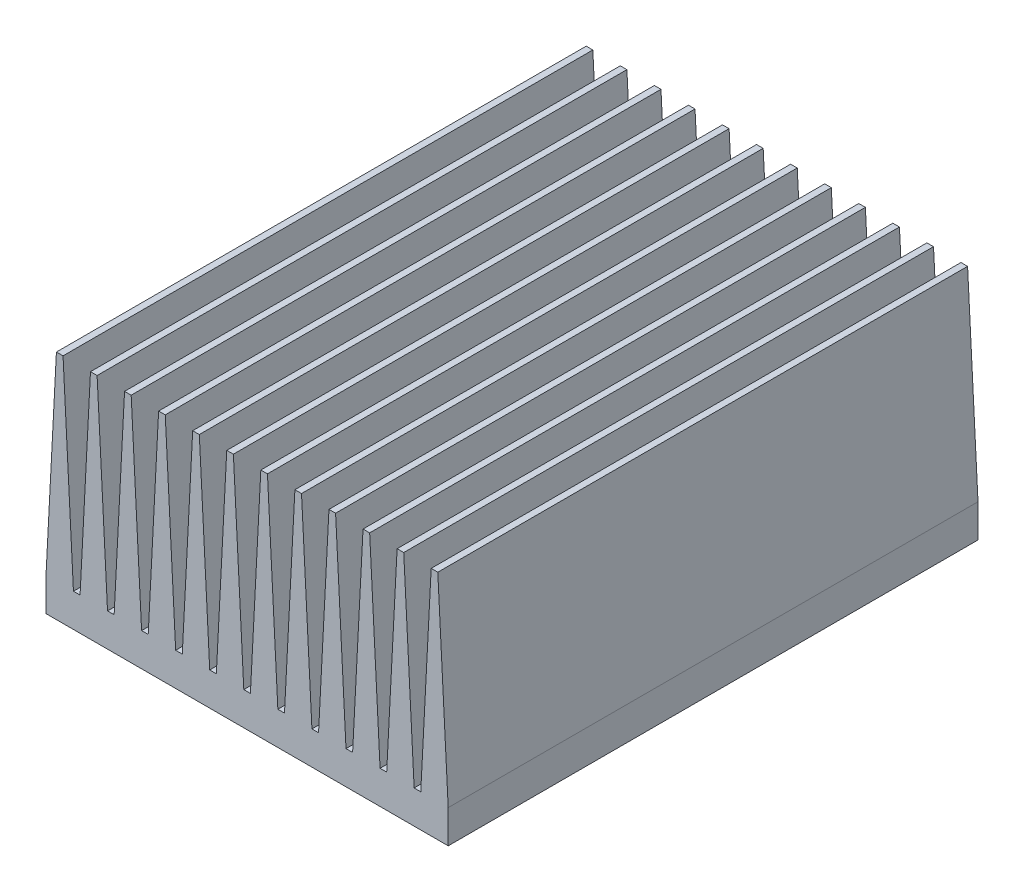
ISO-10303-21;
HEADER;
FILE_DESCRIPTION(('STEP AP214'),'2;1');
FILE_NAME('part.step','',(''),(''),'','','');
FILE_SCHEMA(('AUTOMOTIVE_DESIGN { 1 0 10303 214 1 1 1 1 }'));
ENDSEC;
DATA;
#1=APPLICATION_CONTEXT('core data for automotive mechanical design processes');
#2=APPLICATION_PROTOCOL_DEFINITION('international standard','automotive_design',2000,#1);
#3=PRODUCT_CONTEXT('',#1,'mechanical');
#4=PRODUCT('Part','Part','',(#3));
#5=PRODUCT_RELATED_PRODUCT_CATEGORY('part','',(#4));
#6=PRODUCT_DEFINITION_FORMATION('','',#4);
#7=PRODUCT_DEFINITION_CONTEXT('part definition',#1,'design');
#8=PRODUCT_DEFINITION('design','',#6,#7);
#9=PRODUCT_DEFINITION_SHAPE('','',#8);
#10=(LENGTH_UNIT() NAMED_UNIT(*) SI_UNIT(.MILLI.,.METRE.));
#11=(NAMED_UNIT(*) PLANE_ANGLE_UNIT() SI_UNIT($,.RADIAN.));
#12=(NAMED_UNIT(*) SI_UNIT($,.STERADIAN.) SOLID_ANGLE_UNIT());
#13=UNCERTAINTY_MEASURE_WITH_UNIT(LENGTH_MEASURE(1.E-05),#10,'distance_accuracy_value','');
#14=(GEOMETRIC_REPRESENTATION_CONTEXT(3) GLOBAL_UNCERTAINTY_ASSIGNED_CONTEXT((#13)) GLOBAL_UNIT_ASSIGNED_CONTEXT((#10,
#11,#12)) REPRESENTATION_CONTEXT('',''));
#15=CARTESIAN_POINT('',(0.,0.,0.));
#16=DIRECTION('',(0.,0.,1.));
#17=DIRECTION('',(1.,0.,0.));
#18=AXIS2_PLACEMENT_3D('',#15,#16,#17);
#19=CARTESIAN_POINT('',(30.3668005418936,5.,80.));
#20=DIRECTION('',(-0.998629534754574,-0.0523359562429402,0.));
#21=DIRECTION('',(0.0523359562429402,-0.998629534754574,0.));
#22=AXIS2_PLACEMENT_3D('',#19,#20,#21);
#23=PLANE('',#22);
#24=DIRECTION('',(-0.0523359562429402,0.998629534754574,0.));
#25=VECTOR('',#24,1.);
#26=CARTESIAN_POINT('',(30.3668005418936,5.,0.));
#27=LINE('',#26,#25);
#28=CARTESIAN_POINT('',(30.3668005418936,5.,0.));
#29=VERTEX_POINT('',#28);
#30=CARTESIAN_POINT('',(28.7945671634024,35.,0.));
#31=VERTEX_POINT('',#30);
#32=EDGE_CURVE('E398',#29,#31,#27,.T.);
#33=ORIENTED_EDGE('',*,*,#32,.T.);
#34=DIRECTION('',(0.,0.,-1.));
#35=VECTOR('',#34,1.);
#36=CARTESIAN_POINT('',(28.7945671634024,35.,80.));
#37=LINE('',#36,#35);
#38=CARTESIAN_POINT('',(28.7945671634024,35.,80.));
#39=VERTEX_POINT('',#38);
#40=EDGE_CURVE('E11',#39,#31,#37,.T.);
#41=ORIENTED_EDGE('',*,*,#40,.F.);
#42=DIRECTION('',(-0.0523359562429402,0.998629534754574,0.));
#43=VECTOR('',#42,1.);
#44=CARTESIAN_POINT('',(30.3668005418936,5.,80.));
#45=LINE('',#44,#43);
#46=CARTESIAN_POINT('',(30.3668005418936,5.,80.));
#47=VERTEX_POINT('',#46);
#48=EDGE_CURVE('E546',#47,#39,#45,.T.);
#49=ORIENTED_EDGE('',*,*,#48,.F.);
#50=DIRECTION('',(0.,0.,-1.));
#51=VECTOR('',#50,1.);
#52=CARTESIAN_POINT('',(30.3668005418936,5.,80.));
#53=LINE('',#52,#51);
#54=EDGE_CURVE('E394',#47,#29,#53,.T.);
#55=ORIENTED_EDGE('',*,*,#54,.T.);
#56=EDGE_LOOP('',(#33,#41,#49,#55));
#57=FACE_BOUND('',#56,.T.);
#58=ADVANCED_FACE('F45',(#57),#23,.F.);
#59=CARTESIAN_POINT('',(28.7945671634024,35.,80.));
#60=DIRECTION('',(0.,-1.,0.));
#61=DIRECTION('',(0.,0.,-1.));
#62=AXIS2_PLACEMENT_3D('',#59,#60,#61);
#63=PLANE('',#62);
#64=DIRECTION('',(-1.,0.,0.));
#65=VECTOR('',#64,1.);
#66=CARTESIAN_POINT('',(28.7945671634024,35.,0.));
#67=LINE('',#66,#65);
#68=CARTESIAN_POINT('',(27.7945671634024,35.,0.));
#69=VERTEX_POINT('',#68);
#70=EDGE_CURVE('E402',#31,#69,#67,.T.);
#71=ORIENTED_EDGE('',*,*,#70,.T.);
#72=DIRECTION('',(0.,0.,-1.));
#73=VECTOR('',#72,1.);
#74=CARTESIAN_POINT('',(27.7945671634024,35.,80.));
#75=LINE('',#74,#73);
#76=CARTESIAN_POINT('',(27.7945671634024,35.,80.));
#77=VERTEX_POINT('',#76);
#78=EDGE_CURVE('E54',#77,#69,#75,.T.);
#79=ORIENTED_EDGE('',*,*,#78,.F.);
#80=DIRECTION('',(-1.,0.,0.));
#81=VECTOR('',#80,1.);
#82=CARTESIAN_POINT('',(28.7945671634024,35.,80.));
#83=LINE('',#82,#81);
#84=EDGE_CURVE('E231',#39,#77,#83,.T.);
#85=ORIENTED_EDGE('',*,*,#84,.F.);
#86=ORIENTED_EDGE('',*,*,#40,.T.);
#87=EDGE_LOOP('',(#71,#79,#85,#86));
#88=FACE_BOUND('',#87,.T.);
#89=ADVANCED_FACE('F906',(#88),#63,.F.);
#90=CARTESIAN_POINT('',(27.7945671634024,35.,80.));
#91=DIRECTION('',(0.998629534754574,-0.0523359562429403,0.));
#92=DIRECTION('',(0.0523359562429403,0.998629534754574,0.));
#93=AXIS2_PLACEMENT_3D('',#90,#91,#92);
#94=PLANE('',#93);
#95=DIRECTION('',(-0.0523359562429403,-0.998629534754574,0.));
#96=VECTOR('',#95,1.);
#97=CARTESIAN_POINT('',(27.7945671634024,35.,0.));
#98=LINE('',#97,#96);
#99=CARTESIAN_POINT('',(26.2223337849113,5.00000000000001,0.));
#100=VERTEX_POINT('',#99);
#101=EDGE_CURVE('E405',#69,#100,#98,.T.);
#102=ORIENTED_EDGE('',*,*,#101,.T.);
#103=DIRECTION('',(0.,0.,-1.));
#104=VECTOR('',#103,1.);
#105=CARTESIAN_POINT('',(26.2223337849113,5.00000000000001,80.));
#106=LINE('',#105,#104);
#107=CARTESIAN_POINT('',(26.2223337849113,5.00000000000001,80.));
#108=VERTEX_POINT('',#107);
#109=EDGE_CURVE('E725',#108,#100,#106,.T.);
#110=ORIENTED_EDGE('',*,*,#109,.F.);
#111=DIRECTION('',(-0.0523359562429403,-0.998629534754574,0.));
#112=VECTOR('',#111,1.);
#113=CARTESIAN_POINT('',(27.7945671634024,35.,80.));
#114=LINE('',#113,#112);
#115=EDGE_CURVE('E735',#77,#108,#114,.T.);
#116=ORIENTED_EDGE('',*,*,#115,.F.);
#117=ORIENTED_EDGE('',*,*,#78,.T.);
#118=EDGE_LOOP('',(#102,#110,#116,#117));
#119=FACE_BOUND('',#118,.T.);
#120=ADVANCED_FACE('F733',(#119),#94,.F.);
#121=CARTESIAN_POINT('',(26.2223337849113,5.00000000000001,80.));
#122=DIRECTION('',(0.,-1.,0.));
#123=DIRECTION('',(0.,0.,-1.));
#124=AXIS2_PLACEMENT_3D('',#121,#122,#123);
#125=PLANE('',#124);
#126=DIRECTION('',(-1.,0.,0.));
#127=VECTOR('',#126,1.);
#128=CARTESIAN_POINT('',(26.2223337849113,5.00000000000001,0.));
#129=LINE('',#128,#127);
#130=CARTESIAN_POINT('',(25.2223337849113,5.00000000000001,0.));
#131=VERTEX_POINT('',#130);
#132=EDGE_CURVE('E408',#100,#131,#129,.T.);
#133=ORIENTED_EDGE('',*,*,#132,.T.);
#134=DIRECTION('',(0.,0.,-1.));
#135=VECTOR('',#134,1.);
#136=CARTESIAN_POINT('',(25.2223337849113,5.00000000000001,80.));
#137=LINE('',#136,#135);
#138=CARTESIAN_POINT('',(25.2223337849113,5.00000000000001,80.));
#139=VERTEX_POINT('',#138);
#140=EDGE_CURVE('E721',#139,#131,#137,.T.);
#141=ORIENTED_EDGE('',*,*,#140,.F.);
#142=DIRECTION('',(-1.,0.,0.));
#143=VECTOR('',#142,1.);
#144=CARTESIAN_POINT('',(26.2223337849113,5.00000000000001,80.));
#145=LINE('',#144,#143);
#146=EDGE_CURVE('E754',#108,#139,#145,.T.);
#147=ORIENTED_EDGE('',*,*,#146,.F.);
#148=ORIENTED_EDGE('',*,*,#109,.T.);
#149=EDGE_LOOP('',(#133,#141,#147,#148));
#150=FACE_BOUND('',#149,.T.);
#151=ADVANCED_FACE('F744',(#150),#125,.F.);
#152=CARTESIAN_POINT('',(25.2223337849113,5.00000000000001,80.));
#153=DIRECTION('',(-0.998629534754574,-0.0523359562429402,0.));
#154=DIRECTION('',(0.0523359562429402,-0.998629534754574,0.));
#155=AXIS2_PLACEMENT_3D('',#152,#153,#154);
#156=PLANE('',#155);
#157=DIRECTION('',(-0.0523359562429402,0.998629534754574,0.));
#158=VECTOR('',#157,1.);
#159=CARTESIAN_POINT('',(25.2223337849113,5.00000000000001,0.));
#160=LINE('',#159,#158);
#161=CARTESIAN_POINT('',(23.6501004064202,35.,0.));
#162=VERTEX_POINT('',#161);
#163=EDGE_CURVE('E411',#131,#162,#160,.T.);
#164=ORIENTED_EDGE('',*,*,#163,.T.);
#165=DIRECTION('',(0.,0.,-1.));
#166=VECTOR('',#165,1.);
#167=CARTESIAN_POINT('',(23.6501004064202,35.,80.));
#168=LINE('',#167,#166);
#169=CARTESIAN_POINT('',(23.6501004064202,35.,80.));
#170=VERTEX_POINT('',#169);
#171=EDGE_CURVE('E717',#170,#162,#168,.T.);
#172=ORIENTED_EDGE('',*,*,#171,.F.);
#173=DIRECTION('',(-0.0523359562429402,0.998629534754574,0.));
#174=VECTOR('',#173,1.);
#175=CARTESIAN_POINT('',(25.2223337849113,5.00000000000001,80.));
#176=LINE('',#175,#174);
#177=EDGE_CURVE('E750',#139,#170,#176,.T.);
#178=ORIENTED_EDGE('',*,*,#177,.F.);
#179=ORIENTED_EDGE('',*,*,#140,.T.);
#180=EDGE_LOOP('',(#164,#172,#178,#179));
#181=FACE_BOUND('',#180,.T.);
#182=ADVANCED_FACE('F748',(#181),#156,.F.);
#183=CARTESIAN_POINT('',(23.6501004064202,35.,80.));
#184=DIRECTION('',(0.,-1.,0.));
#185=DIRECTION('',(0.,0.,-1.));
#186=AXIS2_PLACEMENT_3D('',#183,#184,#185);
#187=PLANE('',#186);
#188=DIRECTION('',(-1.,0.,0.));
#189=VECTOR('',#188,1.);
#190=CARTESIAN_POINT('',(23.6501004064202,35.,0.));
#191=LINE('',#190,#189);
#192=CARTESIAN_POINT('',(22.6501004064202,35.,0.));
#193=VERTEX_POINT('',#192);
#194=EDGE_CURVE('E414',#162,#193,#191,.T.);
#195=ORIENTED_EDGE('',*,*,#194,.T.);
#196=DIRECTION('',(0.,0.,-1.));
#197=VECTOR('',#196,1.);
#198=CARTESIAN_POINT('',(22.6501004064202,35.,80.));
#199=LINE('',#198,#197);
#200=CARTESIAN_POINT('',(22.6501004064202,35.,80.));
#201=VERTEX_POINT('',#200);
#202=EDGE_CURVE('E713',#201,#193,#199,.T.);
#203=ORIENTED_EDGE('',*,*,#202,.F.);
#204=DIRECTION('',(-1.,0.,0.));
#205=VECTOR('',#204,1.);
#206=CARTESIAN_POINT('',(23.6501004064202,35.,80.));
#207=LINE('',#206,#205);
#208=EDGE_CURVE('E753',#170,#201,#207,.T.);
#209=ORIENTED_EDGE('',*,*,#208,.F.);
#210=ORIENTED_EDGE('',*,*,#171,.T.);
#211=EDGE_LOOP('',(#195,#203,#209,#210));
#212=FACE_BOUND('',#211,.T.);
#213=ADVANCED_FACE('F919',(#212),#187,.F.);
#214=CARTESIAN_POINT('',(22.6501004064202,35.,80.));
#215=DIRECTION('',(0.998629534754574,-0.0523359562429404,0.));
#216=DIRECTION('',(0.0523359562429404,0.998629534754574,0.));
#217=AXIS2_PLACEMENT_3D('',#214,#215,#216);
#218=PLANE('',#217);
#219=DIRECTION('',(-0.0523359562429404,-0.998629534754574,0.));
#220=VECTOR('',#219,1.);
#221=CARTESIAN_POINT('',(22.6501004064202,35.,0.));
#222=LINE('',#221,#220);
#223=CARTESIAN_POINT('',(21.077867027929,5.00000000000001,0.));
#224=VERTEX_POINT('',#223);
#225=EDGE_CURVE('E417',#193,#224,#222,.T.);
#226=ORIENTED_EDGE('',*,*,#225,.T.);
#227=DIRECTION('',(0.,0.,-1.));
#228=VECTOR('',#227,1.);
#229=CARTESIAN_POINT('',(21.077867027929,5.00000000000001,80.));
#230=LINE('',#229,#228);
#231=CARTESIAN_POINT('',(21.077867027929,5.00000000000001,80.));
#232=VERTEX_POINT('',#231);
#233=EDGE_CURVE('E709',#232,#224,#230,.T.);
#234=ORIENTED_EDGE('',*,*,#233,.F.);
#235=DIRECTION('',(-0.0523359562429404,-0.998629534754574,0.));
#236=VECTOR('',#235,1.);
#237=CARTESIAN_POINT('',(22.6501004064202,35.,80.));
#238=LINE('',#237,#236);
#239=EDGE_CURVE('E758',#201,#232,#238,.T.);
#240=ORIENTED_EDGE('',*,*,#239,.F.);
#241=ORIENTED_EDGE('',*,*,#202,.T.);
#242=EDGE_LOOP('',(#226,#234,#240,#241));
#243=FACE_BOUND('',#242,.T.);
#244=ADVANCED_FACE('F922',(#243),#218,.F.);
#245=CARTESIAN_POINT('',(21.077867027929,5.00000000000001,80.));
#246=DIRECTION('',(0.,-1.,0.));
#247=DIRECTION('',(1.,0.,0.));
#248=AXIS2_PLACEMENT_3D('',#245,#246,#247);
#249=PLANE('',#248);
#250=DIRECTION('',(-1.,0.,0.));
#251=VECTOR('',#250,1.);
#252=CARTESIAN_POINT('',(21.077867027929,5.00000000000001,0.));
#253=LINE('',#252,#251);
#254=CARTESIAN_POINT('',(20.077867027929,5.,0.));
#255=VERTEX_POINT('',#254);
#256=EDGE_CURVE('E420',#224,#255,#253,.T.);
#257=ORIENTED_EDGE('',*,*,#256,.T.);
#258=DIRECTION('',(0.,0.,-1.));
#259=VECTOR('',#258,1.);
#260=CARTESIAN_POINT('',(20.077867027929,5.,80.));
#261=LINE('',#260,#259);
#262=CARTESIAN_POINT('',(20.077867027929,5.,80.));
#263=VERTEX_POINT('',#262);
#264=EDGE_CURVE('E705',#263,#255,#261,.T.);
#265=ORIENTED_EDGE('',*,*,#264,.F.);
#266=DIRECTION('',(-1.,0.,0.));
#267=VECTOR('',#266,1.);
#268=CARTESIAN_POINT('',(21.077867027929,5.00000000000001,80.));
#269=LINE('',#268,#267);
#270=EDGE_CURVE('E765',#232,#263,#269,.T.);
#271=ORIENTED_EDGE('',*,*,#270,.F.);
#272=ORIENTED_EDGE('',*,*,#233,.T.);
#273=EDGE_LOOP('',(#257,#265,#271,#272));
#274=FACE_BOUND('',#273,.T.);
#275=ADVANCED_FACE('F926',(#274),#249,.F.);
#276=CARTESIAN_POINT('',(20.077867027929,5.,80.));
#277=DIRECTION('',(-0.998629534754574,-0.0523359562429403,0.));
#278=DIRECTION('',(0.0523359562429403,-0.998629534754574,0.));
#279=AXIS2_PLACEMENT_3D('',#276,#277,#278);
#280=PLANE('',#279);
#281=DIRECTION('',(-0.0523359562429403,0.998629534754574,0.));
#282=VECTOR('',#281,1.);
#283=CARTESIAN_POINT('',(20.077867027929,5.,0.));
#284=LINE('',#283,#282);
#285=CARTESIAN_POINT('',(18.5056336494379,34.9999999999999,0.));
#286=VERTEX_POINT('',#285);
#287=EDGE_CURVE('E423',#255,#286,#284,.T.);
#288=ORIENTED_EDGE('',*,*,#287,.T.);
#289=DIRECTION('',(0.,0.,-1.));
#290=VECTOR('',#289,1.);
#291=CARTESIAN_POINT('',(18.5056336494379,34.9999999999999,80.));
#292=LINE('',#291,#290);
#293=CARTESIAN_POINT('',(18.5056336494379,34.9999999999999,80.));
#294=VERTEX_POINT('',#293);
#295=EDGE_CURVE('E701',#294,#286,#292,.T.);
#296=ORIENTED_EDGE('',*,*,#295,.F.);
#297=DIRECTION('',(-0.0523359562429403,0.998629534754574,0.));
#298=VECTOR('',#297,1.);
#299=CARTESIAN_POINT('',(20.077867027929,5.,80.));
#300=LINE('',#299,#298);
#301=EDGE_CURVE('E768',#263,#294,#300,.T.);
#302=ORIENTED_EDGE('',*,*,#301,.F.);
#303=ORIENTED_EDGE('',*,*,#264,.T.);
#304=EDGE_LOOP('',(#288,#296,#302,#303));
#305=FACE_BOUND('',#304,.T.);
#306=ADVANCED_FACE('F930',(#305),#280,.F.);
#307=CARTESIAN_POINT('',(18.5056336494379,34.9999999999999,80.));
#308=DIRECTION('',(0.,-1.,0.));
#309=DIRECTION('',(0.,0.,-1.));
#310=AXIS2_PLACEMENT_3D('',#307,#308,#309);
#311=PLANE('',#310);
#312=DIRECTION('',(-1.,0.,0.));
#313=VECTOR('',#312,1.);
#314=CARTESIAN_POINT('',(18.5056336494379,34.9999999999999,0.));
#315=LINE('',#314,#313);
#316=CARTESIAN_POINT('',(17.5056336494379,34.9999999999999,0.));
#317=VERTEX_POINT('',#316);
#318=EDGE_CURVE('E426',#286,#317,#315,.T.);
#319=ORIENTED_EDGE('',*,*,#318,.T.);
#320=DIRECTION('',(0.,0.,-1.));
#321=VECTOR('',#320,1.);
#322=CARTESIAN_POINT('',(17.5056336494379,34.9999999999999,80.));
#323=LINE('',#322,#321);
#324=CARTESIAN_POINT('',(17.5056336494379,34.9999999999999,80.));
#325=VERTEX_POINT('',#324);
#326=EDGE_CURVE('E697',#325,#317,#323,.T.);
#327=ORIENTED_EDGE('',*,*,#326,.F.);
#328=DIRECTION('',(-1.,0.,0.));
#329=VECTOR('',#328,1.);
#330=CARTESIAN_POINT('',(18.5056336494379,34.9999999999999,80.));
#331=LINE('',#330,#329);
#332=EDGE_CURVE('E771',#294,#325,#331,.T.);
#333=ORIENTED_EDGE('',*,*,#332,.F.);
#334=ORIENTED_EDGE('',*,*,#295,.T.);
#335=EDGE_LOOP('',(#319,#327,#333,#334));
#336=FACE_BOUND('',#335,.T.);
#337=ADVANCED_FACE('F934',(#336),#311,.F.);
#338=CARTESIAN_POINT('',(17.5056336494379,34.9999999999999,80.));
#339=DIRECTION('',(0.998629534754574,-0.0523359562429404,0.));
#340=DIRECTION('',(0.0523359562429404,0.998629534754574,0.));
#341=AXIS2_PLACEMENT_3D('',#338,#339,#340);
#342=PLANE('',#341);
#343=DIRECTION('',(-0.0523359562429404,-0.998629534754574,0.));
#344=VECTOR('',#343,1.);
#345=CARTESIAN_POINT('',(17.5056336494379,34.9999999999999,0.));
#346=LINE('',#345,#344);
#347=CARTESIAN_POINT('',(15.9334002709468,4.99999999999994,0.));
#348=VERTEX_POINT('',#347);
#349=EDGE_CURVE('E429',#317,#348,#346,.T.);
#350=ORIENTED_EDGE('',*,*,#349,.T.);
#351=DIRECTION('',(0.,0.,-1.));
#352=VECTOR('',#351,1.);
#353=CARTESIAN_POINT('',(15.9334002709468,4.99999999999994,80.));
#354=LINE('',#353,#352);
#355=CARTESIAN_POINT('',(15.9334002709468,4.99999999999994,80.));
#356=VERTEX_POINT('',#355);
#357=EDGE_CURVE('E693',#356,#348,#354,.T.);
#358=ORIENTED_EDGE('',*,*,#357,.F.);
#359=DIRECTION('',(-0.0523359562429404,-0.998629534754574,0.));
#360=VECTOR('',#359,1.);
#361=CARTESIAN_POINT('',(17.5056336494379,34.9999999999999,80.));
#362=LINE('',#361,#360);
#363=EDGE_CURVE('E774',#325,#356,#362,.T.);
#364=ORIENTED_EDGE('',*,*,#363,.F.);
#365=ORIENTED_EDGE('',*,*,#326,.T.);
#366=EDGE_LOOP('',(#350,#358,#364,#365));
#367=FACE_BOUND('',#366,.T.);
#368=ADVANCED_FACE('F938',(#367),#342,.F.);
#369=CARTESIAN_POINT('',(15.9334002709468,4.99999999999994,80.));
#370=DIRECTION('',(0.,-1.,0.));
#371=DIRECTION('',(0.,0.,-1.));
#372=AXIS2_PLACEMENT_3D('',#369,#370,#371);
#373=PLANE('',#372);
#374=DIRECTION('',(-1.,0.,0.));
#375=VECTOR('',#374,1.);
#376=CARTESIAN_POINT('',(15.9334002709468,4.99999999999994,0.));
#377=LINE('',#376,#375);
#378=CARTESIAN_POINT('',(14.9334002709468,4.99999999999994,0.));
#379=VERTEX_POINT('',#378);
#380=EDGE_CURVE('E432',#348,#379,#377,.T.);
#381=ORIENTED_EDGE('',*,*,#380,.T.);
#382=DIRECTION('',(0.,0.,-1.));
#383=VECTOR('',#382,1.);
#384=CARTESIAN_POINT('',(14.9334002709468,4.99999999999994,80.));
#385=LINE('',#384,#383);
#386=CARTESIAN_POINT('',(14.9334002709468,4.99999999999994,80.));
#387=VERTEX_POINT('',#386);
#388=EDGE_CURVE('E689',#387,#379,#385,.T.);
#389=ORIENTED_EDGE('',*,*,#388,.F.);
#390=DIRECTION('',(-1.,0.,0.));
#391=VECTOR('',#390,1.);
#392=CARTESIAN_POINT('',(15.9334002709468,4.99999999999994,80.));
#393=LINE('',#392,#391);
#394=EDGE_CURVE('E777',#356,#387,#393,.T.);
#395=ORIENTED_EDGE('',*,*,#394,.F.);
#396=ORIENTED_EDGE('',*,*,#357,.T.);
#397=EDGE_LOOP('',(#381,#389,#395,#396));
#398=FACE_BOUND('',#397,.T.);
#399=ADVANCED_FACE('F942',(#398),#373,.F.);
#400=CARTESIAN_POINT('',(14.9334002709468,4.99999999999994,80.));
#401=DIRECTION('',(-0.998629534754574,-0.0523359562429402,0.));
#402=DIRECTION('',(0.0523359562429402,-0.998629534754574,0.));
#403=AXIS2_PLACEMENT_3D('',#400,#401,#402);
#404=PLANE('',#403);
#405=DIRECTION('',(-0.0523359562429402,0.998629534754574,0.));
#406=VECTOR('',#405,1.);
#407=CARTESIAN_POINT('',(14.9334002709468,4.99999999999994,0.));
#408=LINE('',#407,#406);
#409=CARTESIAN_POINT('',(13.3611668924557,34.9999999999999,0.));
#410=VERTEX_POINT('',#409);
#411=EDGE_CURVE('E435',#379,#410,#408,.T.);
#412=ORIENTED_EDGE('',*,*,#411,.T.);
#413=DIRECTION('',(0.,0.,-1.));
#414=VECTOR('',#413,1.);
#415=CARTESIAN_POINT('',(13.3611668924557,34.9999999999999,80.));
#416=LINE('',#415,#414);
#417=CARTESIAN_POINT('',(13.3611668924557,34.9999999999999,80.));
#418=VERTEX_POINT('',#417);
#419=EDGE_CURVE('E685',#418,#410,#416,.T.);
#420=ORIENTED_EDGE('',*,*,#419,.F.);
#421=DIRECTION('',(-0.0523359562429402,0.998629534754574,0.));
#422=VECTOR('',#421,1.);
#423=CARTESIAN_POINT('',(14.9334002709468,4.99999999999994,80.));
#424=LINE('',#423,#422);
#425=EDGE_CURVE('E780',#387,#418,#424,.T.);
#426=ORIENTED_EDGE('',*,*,#425,.F.);
#427=ORIENTED_EDGE('',*,*,#388,.T.);
#428=EDGE_LOOP('',(#412,#420,#426,#427));
#429=FACE_BOUND('',#428,.T.);
#430=ADVANCED_FACE('F946',(#429),#404,.F.);
#431=CARTESIAN_POINT('',(13.3611668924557,34.9999999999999,80.));
#432=DIRECTION('',(0.,-1.,0.));
#433=DIRECTION('',(0.,0.,-1.));
#434=AXIS2_PLACEMENT_3D('',#431,#432,#433);
#435=PLANE('',#434);
#436=DIRECTION('',(-1.,0.,0.));
#437=VECTOR('',#436,1.);
#438=CARTESIAN_POINT('',(13.3611668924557,34.9999999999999,0.));
#439=LINE('',#438,#437);
#440=CARTESIAN_POINT('',(12.3611668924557,34.9999999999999,0.));
#441=VERTEX_POINT('',#440);
#442=EDGE_CURVE('E438',#410,#441,#439,.T.);
#443=ORIENTED_EDGE('',*,*,#442,.T.);
#444=DIRECTION('',(0.,0.,-1.));
#445=VECTOR('',#444,1.);
#446=CARTESIAN_POINT('',(12.3611668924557,34.9999999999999,80.));
#447=LINE('',#446,#445);
#448=CARTESIAN_POINT('',(12.3611668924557,34.9999999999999,80.));
#449=VERTEX_POINT('',#448);
#450=EDGE_CURVE('E681',#449,#441,#447,.T.);
#451=ORIENTED_EDGE('',*,*,#450,.F.);
#452=DIRECTION('',(-1.,0.,0.));
#453=VECTOR('',#452,1.);
#454=CARTESIAN_POINT('',(13.3611668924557,34.9999999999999,80.));
#455=LINE('',#454,#453);
#456=EDGE_CURVE('E783',#418,#449,#455,.T.);
#457=ORIENTED_EDGE('',*,*,#456,.F.);
#458=ORIENTED_EDGE('',*,*,#419,.T.);
#459=EDGE_LOOP('',(#443,#451,#457,#458));
#460=FACE_BOUND('',#459,.T.);
#461=ADVANCED_FACE('F950',(#460),#435,.F.);
#462=CARTESIAN_POINT('',(12.3611668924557,34.9999999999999,80.));
#463=DIRECTION('',(0.998629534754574,-0.0523359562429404,0.));
#464=DIRECTION('',(0.0523359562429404,0.998629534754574,0.));
#465=AXIS2_PLACEMENT_3D('',#462,#463,#464);
#466=PLANE('',#465);
#467=DIRECTION('',(-0.0523359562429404,-0.998629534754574,0.));
#468=VECTOR('',#467,1.);
#469=CARTESIAN_POINT('',(12.3611668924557,34.9999999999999,0.));
#470=LINE('',#469,#468);
#471=CARTESIAN_POINT('',(10.7889335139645,4.99999999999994,0.));
#472=VERTEX_POINT('',#471);
#473=EDGE_CURVE('E441',#441,#472,#470,.T.);
#474=ORIENTED_EDGE('',*,*,#473,.T.);
#475=DIRECTION('',(0.,0.,-1.));
#476=VECTOR('',#475,1.);
#477=CARTESIAN_POINT('',(10.7889335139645,4.99999999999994,80.));
#478=LINE('',#477,#476);
#479=CARTESIAN_POINT('',(10.7889335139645,4.99999999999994,80.));
#480=VERTEX_POINT('',#479);
#481=EDGE_CURVE('E677',#480,#472,#478,.T.);
#482=ORIENTED_EDGE('',*,*,#481,.F.);
#483=DIRECTION('',(-0.0523359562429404,-0.998629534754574,0.));
#484=VECTOR('',#483,1.);
#485=CARTESIAN_POINT('',(12.3611668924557,34.9999999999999,80.));
#486=LINE('',#485,#484);
#487=EDGE_CURVE('E786',#449,#480,#486,.T.);
#488=ORIENTED_EDGE('',*,*,#487,.F.);
#489=ORIENTED_EDGE('',*,*,#450,.T.);
#490=EDGE_LOOP('',(#474,#482,#488,#489));
#491=FACE_BOUND('',#490,.T.);
#492=ADVANCED_FACE('F954',(#491),#466,.F.);
#493=CARTESIAN_POINT('',(10.7889335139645,4.99999999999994,80.));
#494=DIRECTION('',(0.,-1.,0.));
#495=DIRECTION('',(1.,0.,0.));
#496=AXIS2_PLACEMENT_3D('',#493,#494,#495);
#497=PLANE('',#496);
#498=DIRECTION('',(-1.,0.,0.));
#499=VECTOR('',#498,1.);
#500=CARTESIAN_POINT('',(10.7889335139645,4.99999999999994,0.));
#501=LINE('',#500,#499);
#502=CARTESIAN_POINT('',(9.78893351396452,4.99999999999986,0.));
#503=VERTEX_POINT('',#502);
#504=EDGE_CURVE('E444',#472,#503,#501,.T.);
#505=ORIENTED_EDGE('',*,*,#504,.T.);
#506=DIRECTION('',(0.,0.,-1.));
#507=VECTOR('',#506,1.);
#508=CARTESIAN_POINT('',(9.78893351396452,4.99999999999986,80.));
#509=LINE('',#508,#507);
#510=CARTESIAN_POINT('',(9.78893351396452,4.99999999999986,80.));
#511=VERTEX_POINT('',#510);
#512=EDGE_CURVE('E673',#511,#503,#509,.T.);
#513=ORIENTED_EDGE('',*,*,#512,.F.);
#514=DIRECTION('',(-1.,0.,0.));
#515=VECTOR('',#514,1.);
#516=CARTESIAN_POINT('',(10.7889335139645,4.99999999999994,80.));
#517=LINE('',#516,#515);
#518=EDGE_CURVE('E789',#480,#511,#517,.T.);
#519=ORIENTED_EDGE('',*,*,#518,.F.);
#520=ORIENTED_EDGE('',*,*,#481,.T.);
#521=EDGE_LOOP('',(#505,#513,#519,#520));
#522=FACE_BOUND('',#521,.T.);
#523=ADVANCED_FACE('F958',(#522),#497,.F.);
#524=CARTESIAN_POINT('',(9.78893351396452,4.99999999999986,80.));
#525=DIRECTION('',(-0.998629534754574,-0.0523359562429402,0.));
#526=DIRECTION('',(0.0523359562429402,-0.998629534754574,0.));
#527=AXIS2_PLACEMENT_3D('',#524,#525,#526);
#528=PLANE('',#527);
#529=DIRECTION('',(-0.0523359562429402,0.998629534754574,0.));
#530=VECTOR('',#529,1.);
#531=CARTESIAN_POINT('',(9.78893351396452,4.99999999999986,0.));
#532=LINE('',#531,#530);
#533=CARTESIAN_POINT('',(8.21670013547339,34.9999999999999,0.));
#534=VERTEX_POINT('',#533);
#535=EDGE_CURVE('E447',#503,#534,#532,.T.);
#536=ORIENTED_EDGE('',*,*,#535,.T.);
#537=DIRECTION('',(0.,0.,-1.));
#538=VECTOR('',#537,1.);
#539=CARTESIAN_POINT('',(8.21670013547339,34.9999999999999,80.));
#540=LINE('',#539,#538);
#541=CARTESIAN_POINT('',(8.21670013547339,34.9999999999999,80.));
#542=VERTEX_POINT('',#541);
#543=EDGE_CURVE('E669',#542,#534,#540,.T.);
#544=ORIENTED_EDGE('',*,*,#543,.F.);
#545=DIRECTION('',(-0.0523359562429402,0.998629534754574,0.));
#546=VECTOR('',#545,1.);
#547=CARTESIAN_POINT('',(9.78893351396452,4.99999999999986,80.));
#548=LINE('',#547,#546);
#549=EDGE_CURVE('E792',#511,#542,#548,.T.);
#550=ORIENTED_EDGE('',*,*,#549,.F.);
#551=ORIENTED_EDGE('',*,*,#512,.T.);
#552=EDGE_LOOP('',(#536,#544,#550,#551));
#553=FACE_BOUND('',#552,.T.);
#554=ADVANCED_FACE('F962',(#553),#528,.F.);
#555=CARTESIAN_POINT('',(8.21670013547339,34.9999999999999,80.));
#556=DIRECTION('',(0.,-1.,0.));
#557=DIRECTION('',(0.,0.,-1.));
#558=AXIS2_PLACEMENT_3D('',#555,#556,#557);
#559=PLANE('',#558);
#560=DIRECTION('',(-1.,0.,0.));
#561=VECTOR('',#560,1.);
#562=CARTESIAN_POINT('',(8.21670013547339,34.9999999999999,0.));
#563=LINE('',#562,#561);
#564=CARTESIAN_POINT('',(7.21670013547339,34.9999999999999,0.));
#565=VERTEX_POINT('',#564);
#566=EDGE_CURVE('E450',#534,#565,#563,.T.);
#567=ORIENTED_EDGE('',*,*,#566,.T.);
#568=DIRECTION('',(0.,0.,-1.));
#569=VECTOR('',#568,1.);
#570=CARTESIAN_POINT('',(7.21670013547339,34.9999999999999,80.));
#571=LINE('',#570,#569);
#572=CARTESIAN_POINT('',(7.21670013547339,34.9999999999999,80.));
#573=VERTEX_POINT('',#572);
#574=EDGE_CURVE('E665',#573,#565,#571,.T.);
#575=ORIENTED_EDGE('',*,*,#574,.F.);
#576=DIRECTION('',(-1.,0.,0.));
#577=VECTOR('',#576,1.);
#578=CARTESIAN_POINT('',(8.21670013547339,34.9999999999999,80.));
#579=LINE('',#578,#577);
#580=EDGE_CURVE('E795',#542,#573,#579,.T.);
#581=ORIENTED_EDGE('',*,*,#580,.F.);
#582=ORIENTED_EDGE('',*,*,#543,.T.);
#583=EDGE_LOOP('',(#567,#575,#581,#582));
#584=FACE_BOUND('',#583,.T.);
#585=ADVANCED_FACE('F966',(#584),#559,.F.);
#586=CARTESIAN_POINT('',(7.21670013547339,34.9999999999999,80.));
#587=DIRECTION('',(0.998629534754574,-0.0523359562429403,0.));
#588=DIRECTION('',(0.0523359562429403,0.998629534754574,0.));
#589=AXIS2_PLACEMENT_3D('',#586,#587,#588);
#590=PLANE('',#589);
#591=DIRECTION('',(-0.0523359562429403,-0.998629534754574,0.));
#592=VECTOR('',#591,1.);
#593=CARTESIAN_POINT('',(7.21670013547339,34.9999999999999,0.));
#594=LINE('',#593,#592);
#595=CARTESIAN_POINT('',(5.64446675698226,4.99999999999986,0.));
#596=VERTEX_POINT('',#595);
#597=EDGE_CURVE('E453',#565,#596,#594,.T.);
#598=ORIENTED_EDGE('',*,*,#597,.T.);
#599=DIRECTION('',(0.,0.,-1.));
#600=VECTOR('',#599,1.);
#601=CARTESIAN_POINT('',(5.64446675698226,4.99999999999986,80.));
#602=LINE('',#601,#600);
#603=CARTESIAN_POINT('',(5.64446675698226,4.99999999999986,80.));
#604=VERTEX_POINT('',#603);
#605=EDGE_CURVE('E661',#604,#596,#602,.T.);
#606=ORIENTED_EDGE('',*,*,#605,.F.);
#607=DIRECTION('',(-0.0523359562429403,-0.998629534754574,0.));
#608=VECTOR('',#607,1.);
#609=CARTESIAN_POINT('',(7.21670013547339,34.9999999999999,80.));
#610=LINE('',#609,#608);
#611=EDGE_CURVE('E798',#573,#604,#610,.T.);
#612=ORIENTED_EDGE('',*,*,#611,.F.);
#613=ORIENTED_EDGE('',*,*,#574,.T.);
#614=EDGE_LOOP('',(#598,#606,#612,#613));
#615=FACE_BOUND('',#614,.T.);
#616=ADVANCED_FACE('F970',(#615),#590,.F.);
#617=CARTESIAN_POINT('',(5.64446675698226,4.99999999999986,80.));
#618=DIRECTION('',(0.,-1.,0.));
#619=DIRECTION('',(0.,0.,-1.));
#620=AXIS2_PLACEMENT_3D('',#617,#618,#619);
#621=PLANE('',#620);
#622=DIRECTION('',(-1.,0.,0.));
#623=VECTOR('',#622,1.);
#624=CARTESIAN_POINT('',(5.64446675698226,4.99999999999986,0.));
#625=LINE('',#624,#623);
#626=CARTESIAN_POINT('',(4.64446675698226,4.99999999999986,0.));
#627=VERTEX_POINT('',#626);
#628=EDGE_CURVE('E456',#596,#627,#625,.T.);
#629=ORIENTED_EDGE('',*,*,#628,.T.);
#630=DIRECTION('',(0.,0.,-1.));
#631=VECTOR('',#630,1.);
#632=CARTESIAN_POINT('',(4.64446675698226,4.99999999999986,80.));
#633=LINE('',#632,#631);
#634=CARTESIAN_POINT('',(4.64446675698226,4.99999999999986,80.));
#635=VERTEX_POINT('',#634);
#636=EDGE_CURVE('E657',#635,#627,#633,.T.);
#637=ORIENTED_EDGE('',*,*,#636,.F.);
#638=DIRECTION('',(-1.,0.,0.));
#639=VECTOR('',#638,1.);
#640=CARTESIAN_POINT('',(5.64446675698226,4.99999999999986,80.));
#641=LINE('',#640,#639);
#642=EDGE_CURVE('E801',#604,#635,#641,.T.);
#643=ORIENTED_EDGE('',*,*,#642,.F.);
#644=ORIENTED_EDGE('',*,*,#605,.T.);
#645=EDGE_LOOP('',(#629,#637,#643,#644));
#646=FACE_BOUND('',#645,.T.);
#647=ADVANCED_FACE('F974',(#646),#621,.F.);
#648=CARTESIAN_POINT('',(4.64446675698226,4.99999999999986,80.));
#649=DIRECTION('',(-0.998629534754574,-0.0523359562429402,0.));
#650=DIRECTION('',(0.0523359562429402,-0.998629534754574,0.));
#651=AXIS2_PLACEMENT_3D('',#648,#649,#650);
#652=PLANE('',#651);
#653=DIRECTION('',(-0.0523359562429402,0.998629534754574,0.));
#654=VECTOR('',#653,1.);
#655=CARTESIAN_POINT('',(4.64446675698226,4.99999999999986,0.));
#656=LINE('',#655,#654);
#657=CARTESIAN_POINT('',(3.07223337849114,34.9999999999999,0.));
#658=VERTEX_POINT('',#657);
#659=EDGE_CURVE('E459',#627,#658,#656,.T.);
#660=ORIENTED_EDGE('',*,*,#659,.T.);
#661=DIRECTION('',(0.,0.,-1.));
#662=VECTOR('',#661,1.);
#663=CARTESIAN_POINT('',(3.07223337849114,34.9999999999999,80.));
#664=LINE('',#663,#662);
#665=CARTESIAN_POINT('',(3.07223337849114,34.9999999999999,80.));
#666=VERTEX_POINT('',#665);
#667=EDGE_CURVE('E653',#666,#658,#664,.T.);
#668=ORIENTED_EDGE('',*,*,#667,.F.);
#669=DIRECTION('',(-0.0523359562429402,0.998629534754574,0.));
#670=VECTOR('',#669,1.);
#671=CARTESIAN_POINT('',(4.64446675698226,4.99999999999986,80.));
#672=LINE('',#671,#670);
#673=EDGE_CURVE('E804',#635,#666,#672,.T.);
#674=ORIENTED_EDGE('',*,*,#673,.F.);
#675=ORIENTED_EDGE('',*,*,#636,.T.);
#676=EDGE_LOOP('',(#660,#668,#674,#675));
#677=FACE_BOUND('',#676,.T.);
#678=ADVANCED_FACE('F978',(#677),#652,.F.);
#679=CARTESIAN_POINT('',(3.07223337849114,34.9999999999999,80.));
#680=DIRECTION('',(0.,-1.,0.));
#681=DIRECTION('',(0.,0.,-1.));
#682=AXIS2_PLACEMENT_3D('',#679,#680,#681);
#683=PLANE('',#682);
#684=DIRECTION('',(-1.,0.,0.));
#685=VECTOR('',#684,1.);
#686=CARTESIAN_POINT('',(3.07223337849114,34.9999999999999,0.));
#687=LINE('',#686,#685);
#688=CARTESIAN_POINT('',(2.07223337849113,34.9999999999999,0.));
#689=VERTEX_POINT('',#688);
#690=EDGE_CURVE('E462',#658,#689,#687,.T.);
#691=ORIENTED_EDGE('',*,*,#690,.T.);
#692=DIRECTION('',(0.,0.,-1.));
#693=VECTOR('',#692,1.);
#694=CARTESIAN_POINT('',(2.07223337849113,34.9999999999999,80.));
#695=LINE('',#694,#693);
#696=CARTESIAN_POINT('',(2.07223337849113,34.9999999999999,80.));
#697=VERTEX_POINT('',#696);
#698=EDGE_CURVE('E649',#697,#689,#695,.T.);
#699=ORIENTED_EDGE('',*,*,#698,.F.);
#700=DIRECTION('',(-1.,0.,0.));
#701=VECTOR('',#700,1.);
#702=CARTESIAN_POINT('',(3.07223337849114,34.9999999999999,80.));
#703=LINE('',#702,#701);
#704=EDGE_CURVE('E807',#666,#697,#703,.T.);
#705=ORIENTED_EDGE('',*,*,#704,.F.);
#706=ORIENTED_EDGE('',*,*,#667,.T.);
#707=EDGE_LOOP('',(#691,#699,#705,#706));
#708=FACE_BOUND('',#707,.T.);
#709=ADVANCED_FACE('F982',(#708),#683,.F.);
#710=CARTESIAN_POINT('',(2.07223337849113,34.9999999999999,80.));
#711=DIRECTION('',(0.998629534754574,-0.0523359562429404,0.));
#712=DIRECTION('',(0.0523359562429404,0.998629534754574,0.));
#713=AXIS2_PLACEMENT_3D('',#710,#711,#712);
#714=PLANE('',#713);
#715=DIRECTION('',(-0.0523359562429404,-0.998629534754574,0.));
#716=VECTOR('',#715,1.);
#717=CARTESIAN_POINT('',(2.07223337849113,34.9999999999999,0.));
#718=LINE('',#717,#716);
#719=CARTESIAN_POINT('',(0.5,4.99999999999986,0.));
#720=VERTEX_POINT('',#719);
#721=EDGE_CURVE('E465',#689,#720,#718,.T.);
#722=ORIENTED_EDGE('',*,*,#721,.T.);
#723=DIRECTION('',(0.,0.,-1.));
#724=VECTOR('',#723,1.);
#725=CARTESIAN_POINT('',(0.5,4.99999999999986,80.));
#726=LINE('',#725,#724);
#727=CARTESIAN_POINT('',(0.5,4.99999999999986,80.));
#728=VERTEX_POINT('',#727);
#729=EDGE_CURVE('E645',#728,#720,#726,.T.);
#730=ORIENTED_EDGE('',*,*,#729,.F.);
#731=DIRECTION('',(-0.0523359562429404,-0.998629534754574,0.));
#732=VECTOR('',#731,1.);
#733=CARTESIAN_POINT('',(2.07223337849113,34.9999999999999,80.));
#734=LINE('',#733,#732);
#735=EDGE_CURVE('E810',#697,#728,#734,.T.);
#736=ORIENTED_EDGE('',*,*,#735,.F.);
#737=ORIENTED_EDGE('',*,*,#698,.T.);
#738=EDGE_LOOP('',(#722,#730,#736,#737));
#739=FACE_BOUND('',#738,.T.);
#740=ADVANCED_FACE('F986',(#739),#714,.F.);
#741=CARTESIAN_POINT('',(0.5,4.99999999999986,80.));
#742=DIRECTION('',(0.,-1.,0.));
#743=DIRECTION('',(1.,0.,0.));
#744=AXIS2_PLACEMENT_3D('',#741,#742,#743);
#745=PLANE('',#744);
#746=DIRECTION('',(-1.,0.,0.));
#747=VECTOR('',#746,1.);
#748=CARTESIAN_POINT('',(0.5,4.99999999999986,0.));
#749=LINE('',#748,#747);
#750=CARTESIAN_POINT('',(-0.5,4.99999999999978,0.));
#751=VERTEX_POINT('',#750);
#752=EDGE_CURVE('E468',#720,#751,#749,.T.);
#753=ORIENTED_EDGE('',*,*,#752,.T.);
#754=DIRECTION('',(0.,0.,-1.));
#755=VECTOR('',#754,1.);
#756=CARTESIAN_POINT('',(-0.5,4.99999999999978,80.));
#757=LINE('',#756,#755);
#758=CARTESIAN_POINT('',(-0.5,4.99999999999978,80.));
#759=VERTEX_POINT('',#758);
#760=EDGE_CURVE('E641',#759,#751,#757,.T.);
#761=ORIENTED_EDGE('',*,*,#760,.F.);
#762=DIRECTION('',(-1.,0.,0.));
#763=VECTOR('',#762,1.);
#764=CARTESIAN_POINT('',(0.5,4.99999999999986,80.));
#765=LINE('',#764,#763);
#766=EDGE_CURVE('E813',#728,#759,#765,.T.);
#767=ORIENTED_EDGE('',*,*,#766,.F.);
#768=ORIENTED_EDGE('',*,*,#729,.T.);
#769=EDGE_LOOP('',(#753,#761,#767,#768));
#770=FACE_BOUND('',#769,.T.);
#771=ADVANCED_FACE('F990',(#770),#745,.F.);
#772=CARTESIAN_POINT('',(-0.5,4.99999999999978,80.));
#773=DIRECTION('',(-0.998629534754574,-0.0523359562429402,0.));
#774=DIRECTION('',(0.0523359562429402,-0.998629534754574,0.));
#775=AXIS2_PLACEMENT_3D('',#772,#773,#774);
#776=PLANE('',#775);
#777=DIRECTION('',(-0.0523359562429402,0.998629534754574,0.));
#778=VECTOR('',#777,1.);
#779=CARTESIAN_POINT('',(-0.5,4.99999999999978,0.));
#780=LINE('',#779,#778);
#781=CARTESIAN_POINT('',(-2.07223337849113,34.9999999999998,0.));
#782=VERTEX_POINT('',#781);
#783=EDGE_CURVE('E471',#751,#782,#780,.T.);
#784=ORIENTED_EDGE('',*,*,#783,.T.);
#785=DIRECTION('',(0.,0.,-1.));
#786=VECTOR('',#785,1.);
#787=CARTESIAN_POINT('',(-2.07223337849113,34.9999999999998,80.));
#788=LINE('',#787,#786);
#789=CARTESIAN_POINT('',(-2.07223337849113,34.9999999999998,80.));
#790=VERTEX_POINT('',#789);
#791=EDGE_CURVE('E637',#790,#782,#788,.T.);
#792=ORIENTED_EDGE('',*,*,#791,.F.);
#793=DIRECTION('',(-0.0523359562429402,0.998629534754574,0.));
#794=VECTOR('',#793,1.);
#795=CARTESIAN_POINT('',(-0.5,4.99999999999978,80.));
#796=LINE('',#795,#794);
#797=EDGE_CURVE('E816',#759,#790,#796,.T.);
#798=ORIENTED_EDGE('',*,*,#797,.F.);
#799=ORIENTED_EDGE('',*,*,#760,.T.);
#800=EDGE_LOOP('',(#784,#792,#798,#799));
#801=FACE_BOUND('',#800,.T.);
#802=ADVANCED_FACE('F994',(#801),#776,.F.);
#803=CARTESIAN_POINT('',(-2.07223337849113,34.9999999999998,80.));
#804=DIRECTION('',(0.,-1.,0.));
#805=DIRECTION('',(0.,0.,-1.));
#806=AXIS2_PLACEMENT_3D('',#803,#804,#805);
#807=PLANE('',#806);
#808=DIRECTION('',(-1.,0.,0.));
#809=VECTOR('',#808,1.);
#810=CARTESIAN_POINT('',(-2.07223337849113,34.9999999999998,0.));
#811=LINE('',#810,#809);
#812=CARTESIAN_POINT('',(-3.07223337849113,34.9999999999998,0.));
#813=VERTEX_POINT('',#812);
#814=EDGE_CURVE('E474',#782,#813,#811,.T.);
#815=ORIENTED_EDGE('',*,*,#814,.T.);
#816=DIRECTION('',(0.,0.,-1.));
#817=VECTOR('',#816,1.);
#818=CARTESIAN_POINT('',(-3.07223337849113,34.9999999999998,80.));
#819=LINE('',#818,#817);
#820=CARTESIAN_POINT('',(-3.07223337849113,34.9999999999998,80.));
#821=VERTEX_POINT('',#820);
#822=EDGE_CURVE('E633',#821,#813,#819,.T.);
#823=ORIENTED_EDGE('',*,*,#822,.F.);
#824=DIRECTION('',(-1.,0.,0.));
#825=VECTOR('',#824,1.);
#826=CARTESIAN_POINT('',(-2.07223337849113,34.9999999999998,80.));
#827=LINE('',#826,#825);
#828=EDGE_CURVE('E819',#790,#821,#827,.T.);
#829=ORIENTED_EDGE('',*,*,#828,.F.);
#830=ORIENTED_EDGE('',*,*,#791,.T.);
#831=EDGE_LOOP('',(#815,#823,#829,#830));
#832=FACE_BOUND('',#831,.T.);
#833=ADVANCED_FACE('F998',(#832),#807,.F.);
#834=CARTESIAN_POINT('',(-3.07223337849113,34.9999999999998,80.));
#835=DIRECTION('',(0.998629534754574,-0.0523359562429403,0.));
#836=DIRECTION('',(0.0523359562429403,0.998629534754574,0.));
#837=AXIS2_PLACEMENT_3D('',#834,#835,#836);
#838=PLANE('',#837);
#839=DIRECTION('',(-0.0523359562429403,-0.998629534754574,0.));
#840=VECTOR('',#839,1.);
#841=CARTESIAN_POINT('',(-3.07223337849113,34.9999999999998,0.));
#842=LINE('',#841,#840);
#843=CARTESIAN_POINT('',(-4.64446675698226,4.99999999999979,0.));
#844=VERTEX_POINT('',#843);
#845=EDGE_CURVE('E477',#813,#844,#842,.T.);
#846=ORIENTED_EDGE('',*,*,#845,.T.);
#847=DIRECTION('',(0.,0.,-1.));
#848=VECTOR('',#847,1.);
#849=CARTESIAN_POINT('',(-4.64446675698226,4.99999999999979,80.));
#850=LINE('',#849,#848);
#851=CARTESIAN_POINT('',(-4.64446675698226,4.99999999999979,80.));
#852=VERTEX_POINT('',#851);
#853=EDGE_CURVE('E629',#852,#844,#850,.T.);
#854=ORIENTED_EDGE('',*,*,#853,.F.);
#855=DIRECTION('',(-0.0523359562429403,-0.998629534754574,0.));
#856=VECTOR('',#855,1.);
#857=CARTESIAN_POINT('',(-3.07223337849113,34.9999999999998,80.));
#858=LINE('',#857,#856);
#859=EDGE_CURVE('E822',#821,#852,#858,.T.);
#860=ORIENTED_EDGE('',*,*,#859,.F.);
#861=ORIENTED_EDGE('',*,*,#822,.T.);
#862=EDGE_LOOP('',(#846,#854,#860,#861));
#863=FACE_BOUND('',#862,.T.);
#864=ADVANCED_FACE('F1002',(#863),#838,.F.);
#865=CARTESIAN_POINT('',(-4.64446675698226,4.99999999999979,80.));
#866=DIRECTION('',(0.,-1.,0.));
#867=DIRECTION('',(0.,0.,-1.));
#868=AXIS2_PLACEMENT_3D('',#865,#866,#867);
#869=PLANE('',#868);
#870=DIRECTION('',(-1.,0.,0.));
#871=VECTOR('',#870,1.);
#872=CARTESIAN_POINT('',(-4.64446675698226,4.99999999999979,0.));
#873=LINE('',#872,#871);
#874=CARTESIAN_POINT('',(-5.64446675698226,4.99999999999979,0.));
#875=VERTEX_POINT('',#874);
#876=EDGE_CURVE('E480',#844,#875,#873,.T.);
#877=ORIENTED_EDGE('',*,*,#876,.T.);
#878=DIRECTION('',(0.,0.,-1.));
#879=VECTOR('',#878,1.);
#880=CARTESIAN_POINT('',(-5.64446675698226,4.99999999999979,80.));
#881=LINE('',#880,#879);
#882=CARTESIAN_POINT('',(-5.64446675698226,4.99999999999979,80.));
#883=VERTEX_POINT('',#882);
#884=EDGE_CURVE('E625',#883,#875,#881,.T.);
#885=ORIENTED_EDGE('',*,*,#884,.F.);
#886=DIRECTION('',(-1.,0.,0.));
#887=VECTOR('',#886,1.);
#888=CARTESIAN_POINT('',(-4.64446675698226,4.99999999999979,80.));
#889=LINE('',#888,#887);
#890=EDGE_CURVE('E825',#852,#883,#889,.T.);
#891=ORIENTED_EDGE('',*,*,#890,.F.);
#892=ORIENTED_EDGE('',*,*,#853,.T.);
#893=EDGE_LOOP('',(#877,#885,#891,#892));
#894=FACE_BOUND('',#893,.T.);
#895=ADVANCED_FACE('F1006',(#894),#869,.F.);
#896=CARTESIAN_POINT('',(-5.64446675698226,4.99999999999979,80.));
#897=DIRECTION('',(-0.998629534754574,-0.0523359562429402,0.));
#898=DIRECTION('',(0.0523359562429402,-0.998629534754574,0.));
#899=AXIS2_PLACEMENT_3D('',#896,#897,#898);
#900=PLANE('',#899);
#901=DIRECTION('',(-0.0523359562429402,0.998629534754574,0.));
#902=VECTOR('',#901,1.);
#903=CARTESIAN_POINT('',(-5.64446675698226,4.99999999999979,0.));
#904=LINE('',#903,#902);
#905=CARTESIAN_POINT('',(-7.21670013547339,34.9999999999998,0.));
#906=VERTEX_POINT('',#905);
#907=EDGE_CURVE('E483',#875,#906,#904,.T.);
#908=ORIENTED_EDGE('',*,*,#907,.T.);
#909=DIRECTION('',(0.,0.,-1.));
#910=VECTOR('',#909,1.);
#911=CARTESIAN_POINT('',(-7.21670013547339,34.9999999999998,80.));
#912=LINE('',#911,#910);
#913=CARTESIAN_POINT('',(-7.21670013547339,34.9999999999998,80.));
#914=VERTEX_POINT('',#913);
#915=EDGE_CURVE('E621',#914,#906,#912,.T.);
#916=ORIENTED_EDGE('',*,*,#915,.F.);
#917=DIRECTION('',(-0.0523359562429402,0.998629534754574,0.));
#918=VECTOR('',#917,1.);
#919=CARTESIAN_POINT('',(-5.64446675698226,4.99999999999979,80.));
#920=LINE('',#919,#918);
#921=EDGE_CURVE('E828',#883,#914,#920,.T.);
#922=ORIENTED_EDGE('',*,*,#921,.F.);
#923=ORIENTED_EDGE('',*,*,#884,.T.);
#924=EDGE_LOOP('',(#908,#916,#922,#923));
#925=FACE_BOUND('',#924,.T.);
#926=ADVANCED_FACE('F1010',(#925),#900,.F.);
#927=CARTESIAN_POINT('',(-7.21670013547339,34.9999999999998,80.));
#928=DIRECTION('',(0.,-1.,0.));
#929=DIRECTION('',(0.,0.,-1.));
#930=AXIS2_PLACEMENT_3D('',#927,#928,#929);
#931=PLANE('',#930);
#932=DIRECTION('',(-1.,0.,0.));
#933=VECTOR('',#932,1.);
#934=CARTESIAN_POINT('',(-7.21670013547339,34.9999999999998,0.));
#935=LINE('',#934,#933);
#936=CARTESIAN_POINT('',(-8.21670013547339,34.9999999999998,0.));
#937=VERTEX_POINT('',#936);
#938=EDGE_CURVE('E486',#906,#937,#935,.T.);
#939=ORIENTED_EDGE('',*,*,#938,.T.);
#940=DIRECTION('',(0.,0.,-1.));
#941=VECTOR('',#940,1.);
#942=CARTESIAN_POINT('',(-8.21670013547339,34.9999999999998,80.));
#943=LINE('',#942,#941);
#944=CARTESIAN_POINT('',(-8.21670013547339,34.9999999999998,80.));
#945=VERTEX_POINT('',#944);
#946=EDGE_CURVE('E617',#945,#937,#943,.T.);
#947=ORIENTED_EDGE('',*,*,#946,.F.);
#948=DIRECTION('',(-1.,0.,0.));
#949=VECTOR('',#948,1.);
#950=CARTESIAN_POINT('',(-7.21670013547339,34.9999999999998,80.));
#951=LINE('',#950,#949);
#952=EDGE_CURVE('E831',#914,#945,#951,.T.);
#953=ORIENTED_EDGE('',*,*,#952,.F.);
#954=ORIENTED_EDGE('',*,*,#915,.T.);
#955=EDGE_LOOP('',(#939,#947,#953,#954));
#956=FACE_BOUND('',#955,.T.);
#957=ADVANCED_FACE('F1014',(#956),#931,.F.);
#958=CARTESIAN_POINT('',(-8.21670013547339,34.9999999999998,80.));
#959=DIRECTION('',(0.998629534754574,-0.0523359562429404,0.));
#960=DIRECTION('',(0.0523359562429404,0.998629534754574,0.));
#961=AXIS2_PLACEMENT_3D('',#958,#959,#960);
#962=PLANE('',#961);
#963=DIRECTION('',(-0.0523359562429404,-0.998629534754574,0.));
#964=VECTOR('',#963,1.);
#965=CARTESIAN_POINT('',(-8.21670013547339,34.9999999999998,0.));
#966=LINE('',#965,#964);
#967=CARTESIAN_POINT('',(-9.78893351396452,4.99999999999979,0.));
#968=VERTEX_POINT('',#967);
#969=EDGE_CURVE('E489',#937,#968,#966,.T.);
#970=ORIENTED_EDGE('',*,*,#969,.T.);
#971=DIRECTION('',(0.,0.,-1.));
#972=VECTOR('',#971,1.);
#973=CARTESIAN_POINT('',(-9.78893351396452,4.99999999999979,80.));
#974=LINE('',#973,#972);
#975=CARTESIAN_POINT('',(-9.78893351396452,4.99999999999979,80.));
#976=VERTEX_POINT('',#975);
#977=EDGE_CURVE('E613',#976,#968,#974,.T.);
#978=ORIENTED_EDGE('',*,*,#977,.F.);
#979=DIRECTION('',(-0.0523359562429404,-0.998629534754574,0.));
#980=VECTOR('',#979,1.);
#981=CARTESIAN_POINT('',(-8.21670013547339,34.9999999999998,80.));
#982=LINE('',#981,#980);
#983=EDGE_CURVE('E834',#945,#976,#982,.T.);
#984=ORIENTED_EDGE('',*,*,#983,.F.);
#985=ORIENTED_EDGE('',*,*,#946,.T.);
#986=EDGE_LOOP('',(#970,#978,#984,#985));
#987=FACE_BOUND('',#986,.T.);
#988=ADVANCED_FACE('F1018',(#987),#962,.F.);
#989=CARTESIAN_POINT('',(-9.78893351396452,4.99999999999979,80.));
#990=DIRECTION('',(0.,-1.,0.));
#991=DIRECTION('',(1.,0.,0.));
#992=AXIS2_PLACEMENT_3D('',#989,#990,#991);
#993=PLANE('',#992);
#994=DIRECTION('',(-1.,0.,0.));
#995=VECTOR('',#994,1.);
#996=CARTESIAN_POINT('',(-9.78893351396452,4.99999999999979,0.));
#997=LINE('',#996,#995);
#998=CARTESIAN_POINT('',(-10.7889335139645,4.99999999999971,0.));
#999=VERTEX_POINT('',#998);
#1000=EDGE_CURVE('E492',#968,#999,#997,.T.);
#1001=ORIENTED_EDGE('',*,*,#1000,.T.);
#1002=DIRECTION('',(0.,0.,-1.));
#1003=VECTOR('',#1002,1.);
#1004=CARTESIAN_POINT('',(-10.7889335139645,4.99999999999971,80.));
#1005=LINE('',#1004,#1003);
#1006=CARTESIAN_POINT('',(-10.7889335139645,4.99999999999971,80.));
#1007=VERTEX_POINT('',#1006);
#1008=EDGE_CURVE('E609',#1007,#999,#1005,.T.);
#1009=ORIENTED_EDGE('',*,*,#1008,.F.);
#1010=DIRECTION('',(-1.,0.,0.));
#1011=VECTOR('',#1010,1.);
#1012=CARTESIAN_POINT('',(-9.78893351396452,4.99999999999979,80.));
#1013=LINE('',#1012,#1011);
#1014=EDGE_CURVE('E837',#976,#1007,#1013,.T.);
#1015=ORIENTED_EDGE('',*,*,#1014,.F.);
#1016=ORIENTED_EDGE('',*,*,#977,.T.);
#1017=EDGE_LOOP('',(#1001,#1009,#1015,#1016));
#1018=FACE_BOUND('',#1017,.T.);
#1019=ADVANCED_FACE('F1022',(#1018),#993,.F.);
#1020=CARTESIAN_POINT('',(-10.7889335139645,4.99999999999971,80.));
#1021=DIRECTION('',(-0.998629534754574,-0.0523359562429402,0.));
#1022=DIRECTION('',(0.0523359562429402,-0.998629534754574,0.));
#1023=AXIS2_PLACEMENT_3D('',#1020,#1021,#1022);
#1024=PLANE('',#1023);
#1025=DIRECTION('',(-0.0523359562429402,0.998629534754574,0.));
#1026=VECTOR('',#1025,1.);
#1027=CARTESIAN_POINT('',(-10.7889335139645,4.99999999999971,0.));
#1028=LINE('',#1027,#1026);
#1029=CARTESIAN_POINT('',(-12.3611668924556,34.9999999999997,0.));
#1030=VERTEX_POINT('',#1029);
#1031=EDGE_CURVE('E495',#999,#1030,#1028,.T.);
#1032=ORIENTED_EDGE('',*,*,#1031,.T.);
#1033=DIRECTION('',(0.,0.,-1.));
#1034=VECTOR('',#1033,1.);
#1035=CARTESIAN_POINT('',(-12.3611668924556,34.9999999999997,80.));
#1036=LINE('',#1035,#1034);
#1037=CARTESIAN_POINT('',(-12.3611668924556,34.9999999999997,80.));
#1038=VERTEX_POINT('',#1037);
#1039=EDGE_CURVE('E605',#1038,#1030,#1036,.T.);
#1040=ORIENTED_EDGE('',*,*,#1039,.F.);
#1041=DIRECTION('',(-0.0523359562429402,0.998629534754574,0.));
#1042=VECTOR('',#1041,1.);
#1043=CARTESIAN_POINT('',(-10.7889335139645,4.99999999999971,80.));
#1044=LINE('',#1043,#1042);
#1045=EDGE_CURVE('E840',#1007,#1038,#1044,.T.);
#1046=ORIENTED_EDGE('',*,*,#1045,.F.);
#1047=ORIENTED_EDGE('',*,*,#1008,.T.);
#1048=EDGE_LOOP('',(#1032,#1040,#1046,#1047));
#1049=FACE_BOUND('',#1048,.T.);
#1050=ADVANCED_FACE('F1026',(#1049),#1024,.F.);
#1051=CARTESIAN_POINT('',(-12.3611668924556,34.9999999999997,80.));
#1052=DIRECTION('',(0.,-1.,0.));
#1053=DIRECTION('',(0.,0.,-1.));
#1054=AXIS2_PLACEMENT_3D('',#1051,#1052,#1053);
#1055=PLANE('',#1054);
#1056=DIRECTION('',(-1.,0.,0.));
#1057=VECTOR('',#1056,1.);
#1058=CARTESIAN_POINT('',(-12.3611668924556,34.9999999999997,0.));
#1059=LINE('',#1058,#1057);
#1060=CARTESIAN_POINT('',(-13.3611668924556,34.9999999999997,0.));
#1061=VERTEX_POINT('',#1060);
#1062=EDGE_CURVE('E498',#1030,#1061,#1059,.T.);
#1063=ORIENTED_EDGE('',*,*,#1062,.T.);
#1064=DIRECTION('',(0.,0.,-1.));
#1065=VECTOR('',#1064,1.);
#1066=CARTESIAN_POINT('',(-13.3611668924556,34.9999999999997,80.));
#1067=LINE('',#1066,#1065);
#1068=CARTESIAN_POINT('',(-13.3611668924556,34.9999999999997,80.));
#1069=VERTEX_POINT('',#1068);
#1070=EDGE_CURVE('E601',#1069,#1061,#1067,.T.);
#1071=ORIENTED_EDGE('',*,*,#1070,.F.);
#1072=DIRECTION('',(-1.,0.,0.));
#1073=VECTOR('',#1072,1.);
#1074=CARTESIAN_POINT('',(-12.3611668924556,34.9999999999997,80.));
#1075=LINE('',#1074,#1073);
#1076=EDGE_CURVE('E843',#1038,#1069,#1075,.T.);
#1077=ORIENTED_EDGE('',*,*,#1076,.F.);
#1078=ORIENTED_EDGE('',*,*,#1039,.T.);
#1079=EDGE_LOOP('',(#1063,#1071,#1077,#1078));
#1080=FACE_BOUND('',#1079,.T.);
#1081=ADVANCED_FACE('F1030',(#1080),#1055,.F.);
#1082=CARTESIAN_POINT('',(-13.3611668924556,34.9999999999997,80.));
#1083=DIRECTION('',(0.998629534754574,-0.0523359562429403,0.));
#1084=DIRECTION('',(0.0523359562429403,0.998629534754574,0.));
#1085=AXIS2_PLACEMENT_3D('',#1082,#1083,#1084);
#1086=PLANE('',#1085);
#1087=DIRECTION('',(-0.0523359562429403,-0.998629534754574,0.));
#1088=VECTOR('',#1087,1.);
#1089=CARTESIAN_POINT('',(-13.3611668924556,34.9999999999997,0.));
#1090=LINE('',#1089,#1088);
#1091=CARTESIAN_POINT('',(-14.9334002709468,4.99999999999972,0.));
#1092=VERTEX_POINT('',#1091);
#1093=EDGE_CURVE('E501',#1061,#1092,#1090,.T.);
#1094=ORIENTED_EDGE('',*,*,#1093,.T.);
#1095=DIRECTION('',(0.,0.,-1.));
#1096=VECTOR('',#1095,1.);
#1097=CARTESIAN_POINT('',(-14.9334002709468,4.99999999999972,80.));
#1098=LINE('',#1097,#1096);
#1099=CARTESIAN_POINT('',(-14.9334002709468,4.99999999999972,80.));
#1100=VERTEX_POINT('',#1099);
#1101=EDGE_CURVE('E597',#1100,#1092,#1098,.T.);
#1102=ORIENTED_EDGE('',*,*,#1101,.F.);
#1103=DIRECTION('',(-0.0523359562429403,-0.998629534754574,0.));
#1104=VECTOR('',#1103,1.);
#1105=CARTESIAN_POINT('',(-13.3611668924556,34.9999999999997,80.));
#1106=LINE('',#1105,#1104);
#1107=EDGE_CURVE('E846',#1069,#1100,#1106,.T.);
#1108=ORIENTED_EDGE('',*,*,#1107,.F.);
#1109=ORIENTED_EDGE('',*,*,#1070,.T.);
#1110=EDGE_LOOP('',(#1094,#1102,#1108,#1109));
#1111=FACE_BOUND('',#1110,.T.);
#1112=ADVANCED_FACE('F1034',(#1111),#1086,.F.);
#1113=CARTESIAN_POINT('',(-14.9334002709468,4.99999999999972,80.));
#1114=DIRECTION('',(0.,-1.,0.));
#1115=DIRECTION('',(0.,0.,-1.));
#1116=AXIS2_PLACEMENT_3D('',#1113,#1114,#1115);
#1117=PLANE('',#1116);
#1118=DIRECTION('',(-1.,0.,0.));
#1119=VECTOR('',#1118,1.);
#1120=CARTESIAN_POINT('',(-14.9334002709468,4.99999999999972,0.));
#1121=LINE('',#1120,#1119);
#1122=CARTESIAN_POINT('',(-15.9334002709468,4.99999999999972,0.));
#1123=VERTEX_POINT('',#1122);
#1124=EDGE_CURVE('E504',#1092,#1123,#1121,.T.);
#1125=ORIENTED_EDGE('',*,*,#1124,.T.);
#1126=DIRECTION('',(0.,0.,-1.));
#1127=VECTOR('',#1126,1.);
#1128=CARTESIAN_POINT('',(-15.9334002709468,4.99999999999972,80.));
#1129=LINE('',#1128,#1127);
#1130=CARTESIAN_POINT('',(-15.9334002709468,4.99999999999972,80.));
#1131=VERTEX_POINT('',#1130);
#1132=EDGE_CURVE('E593',#1131,#1123,#1129,.T.);
#1133=ORIENTED_EDGE('',*,*,#1132,.F.);
#1134=DIRECTION('',(-1.,0.,0.));
#1135=VECTOR('',#1134,1.);
#1136=CARTESIAN_POINT('',(-14.9334002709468,4.99999999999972,80.));
#1137=LINE('',#1136,#1135);
#1138=EDGE_CURVE('E849',#1100,#1131,#1137,.T.);
#1139=ORIENTED_EDGE('',*,*,#1138,.F.);
#1140=ORIENTED_EDGE('',*,*,#1101,.T.);
#1141=EDGE_LOOP('',(#1125,#1133,#1139,#1140));
#1142=FACE_BOUND('',#1141,.T.);
#1143=ADVANCED_FACE('F1038',(#1142),#1117,.F.);
#1144=CARTESIAN_POINT('',(-15.9334002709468,4.99999999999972,80.));
#1145=DIRECTION('',(-0.998629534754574,-0.0523359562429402,0.));
#1146=DIRECTION('',(0.0523359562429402,-0.998629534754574,0.));
#1147=AXIS2_PLACEMENT_3D('',#1144,#1145,#1146);
#1148=PLANE('',#1147);
#1149=DIRECTION('',(-0.0523359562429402,0.998629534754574,0.));
#1150=VECTOR('',#1149,1.);
#1151=CARTESIAN_POINT('',(-15.9334002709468,4.99999999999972,0.));
#1152=LINE('',#1151,#1150);
#1153=CARTESIAN_POINT('',(-17.5056336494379,34.9999999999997,0.));
#1154=VERTEX_POINT('',#1153);
#1155=EDGE_CURVE('E507',#1123,#1154,#1152,.T.);
#1156=ORIENTED_EDGE('',*,*,#1155,.T.);
#1157=DIRECTION('',(0.,0.,-1.));
#1158=VECTOR('',#1157,1.);
#1159=CARTESIAN_POINT('',(-17.5056336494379,34.9999999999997,80.));
#1160=LINE('',#1159,#1158);
#1161=CARTESIAN_POINT('',(-17.5056336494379,34.9999999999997,80.));
#1162=VERTEX_POINT('',#1161);
#1163=EDGE_CURVE('E589',#1162,#1154,#1160,.T.);
#1164=ORIENTED_EDGE('',*,*,#1163,.F.);
#1165=DIRECTION('',(-0.0523359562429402,0.998629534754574,0.));
#1166=VECTOR('',#1165,1.);
#1167=CARTESIAN_POINT('',(-15.9334002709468,4.99999999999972,80.));
#1168=LINE('',#1167,#1166);
#1169=EDGE_CURVE('E852',#1131,#1162,#1168,.T.);
#1170=ORIENTED_EDGE('',*,*,#1169,.F.);
#1171=ORIENTED_EDGE('',*,*,#1132,.T.);
#1172=EDGE_LOOP('',(#1156,#1164,#1170,#1171));
#1173=FACE_BOUND('',#1172,.T.);
#1174=ADVANCED_FACE('F1042',(#1173),#1148,.F.);
#1175=CARTESIAN_POINT('',(-17.5056336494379,34.9999999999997,80.));
#1176=DIRECTION('',(0.,-1.,0.));
#1177=DIRECTION('',(0.,0.,-1.));
#1178=AXIS2_PLACEMENT_3D('',#1175,#1176,#1177);
#1179=PLANE('',#1178);
#1180=DIRECTION('',(-1.,0.,0.));
#1181=VECTOR('',#1180,1.);
#1182=CARTESIAN_POINT('',(-17.5056336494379,34.9999999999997,0.));
#1183=LINE('',#1182,#1181);
#1184=CARTESIAN_POINT('',(-18.5056336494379,34.9999999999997,0.));
#1185=VERTEX_POINT('',#1184);
#1186=EDGE_CURVE('E510',#1154,#1185,#1183,.T.);
#1187=ORIENTED_EDGE('',*,*,#1186,.T.);
#1188=DIRECTION('',(0.,0.,-1.));
#1189=VECTOR('',#1188,1.);
#1190=CARTESIAN_POINT('',(-18.5056336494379,34.9999999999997,80.));
#1191=LINE('',#1190,#1189);
#1192=CARTESIAN_POINT('',(-18.5056336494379,34.9999999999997,80.));
#1193=VERTEX_POINT('',#1192);
#1194=EDGE_CURVE('E585',#1193,#1185,#1191,.T.);
#1195=ORIENTED_EDGE('',*,*,#1194,.F.);
#1196=DIRECTION('',(-1.,0.,0.));
#1197=VECTOR('',#1196,1.);
#1198=CARTESIAN_POINT('',(-17.5056336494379,34.9999999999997,80.));
#1199=LINE('',#1198,#1197);
#1200=EDGE_CURVE('E855',#1162,#1193,#1199,.T.);
#1201=ORIENTED_EDGE('',*,*,#1200,.F.);
#1202=ORIENTED_EDGE('',*,*,#1163,.T.);
#1203=EDGE_LOOP('',(#1187,#1195,#1201,#1202));
#1204=FACE_BOUND('',#1203,.T.);
#1205=ADVANCED_FACE('F1046',(#1204),#1179,.F.);
#1206=CARTESIAN_POINT('',(-18.5056336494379,34.9999999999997,80.));
#1207=DIRECTION('',(0.998629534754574,-0.0523359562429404,0.));
#1208=DIRECTION('',(0.0523359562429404,0.998629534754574,0.));
#1209=AXIS2_PLACEMENT_3D('',#1206,#1207,#1208);
#1210=PLANE('',#1209);
#1211=DIRECTION('',(-0.0523359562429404,-0.998629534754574,0.));
#1212=VECTOR('',#1211,1.);
#1213=CARTESIAN_POINT('',(-18.5056336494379,34.9999999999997,0.));
#1214=LINE('',#1213,#1212);
#1215=CARTESIAN_POINT('',(-20.077867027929,4.99999999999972,0.));
#1216=VERTEX_POINT('',#1215);
#1217=EDGE_CURVE('E513',#1185,#1216,#1214,.T.);
#1218=ORIENTED_EDGE('',*,*,#1217,.T.);
#1219=DIRECTION('',(0.,0.,-1.));
#1220=VECTOR('',#1219,1.);
#1221=CARTESIAN_POINT('',(-20.077867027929,4.99999999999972,80.));
#1222=LINE('',#1221,#1220);
#1223=CARTESIAN_POINT('',(-20.077867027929,4.99999999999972,80.));
#1224=VERTEX_POINT('',#1223);
#1225=EDGE_CURVE('E581',#1224,#1216,#1222,.T.);
#1226=ORIENTED_EDGE('',*,*,#1225,.F.);
#1227=DIRECTION('',(-0.0523359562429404,-0.998629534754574,0.));
#1228=VECTOR('',#1227,1.);
#1229=CARTESIAN_POINT('',(-18.5056336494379,34.9999999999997,80.));
#1230=LINE('',#1229,#1228);
#1231=EDGE_CURVE('E858',#1193,#1224,#1230,.T.);
#1232=ORIENTED_EDGE('',*,*,#1231,.F.);
#1233=ORIENTED_EDGE('',*,*,#1194,.T.);
#1234=EDGE_LOOP('',(#1218,#1226,#1232,#1233));
#1235=FACE_BOUND('',#1234,.T.);
#1236=ADVANCED_FACE('F1050',(#1235),#1210,.F.);
#1237=CARTESIAN_POINT('',(-20.077867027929,4.99999999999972,80.));
#1238=DIRECTION('',(0.,-1.,0.));
#1239=DIRECTION('',(1.,0.,0.));
#1240=AXIS2_PLACEMENT_3D('',#1237,#1238,#1239);
#1241=PLANE('',#1240);
#1242=DIRECTION('',(-1.,0.,0.));
#1243=VECTOR('',#1242,1.);
#1244=CARTESIAN_POINT('',(-20.077867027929,4.99999999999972,0.));
#1245=LINE('',#1244,#1243);
#1246=CARTESIAN_POINT('',(-21.077867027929,4.99999999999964,0.));
#1247=VERTEX_POINT('',#1246);
#1248=EDGE_CURVE('E516',#1216,#1247,#1245,.T.);
#1249=ORIENTED_EDGE('',*,*,#1248,.T.);
#1250=DIRECTION('',(0.,0.,-1.));
#1251=VECTOR('',#1250,1.);
#1252=CARTESIAN_POINT('',(-21.077867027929,4.99999999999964,80.));
#1253=LINE('',#1252,#1251);
#1254=CARTESIAN_POINT('',(-21.077867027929,4.99999999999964,80.));
#1255=VERTEX_POINT('',#1254);
#1256=EDGE_CURVE('E577',#1255,#1247,#1253,.T.);
#1257=ORIENTED_EDGE('',*,*,#1256,.F.);
#1258=DIRECTION('',(-1.,0.,0.));
#1259=VECTOR('',#1258,1.);
#1260=CARTESIAN_POINT('',(-20.077867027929,4.99999999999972,80.));
#1261=LINE('',#1260,#1259);
#1262=EDGE_CURVE('E861',#1224,#1255,#1261,.T.);
#1263=ORIENTED_EDGE('',*,*,#1262,.F.);
#1264=ORIENTED_EDGE('',*,*,#1225,.T.);
#1265=EDGE_LOOP('',(#1249,#1257,#1263,#1264));
#1266=FACE_BOUND('',#1265,.T.);
#1267=ADVANCED_FACE('F1054',(#1266),#1241,.F.);
#1268=CARTESIAN_POINT('',(-21.077867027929,4.99999999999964,80.));
#1269=DIRECTION('',(-0.998629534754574,-0.0523359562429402,0.));
#1270=DIRECTION('',(0.0523359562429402,-0.998629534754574,0.));
#1271=AXIS2_PLACEMENT_3D('',#1268,#1269,#1270);
#1272=PLANE('',#1271);
#1273=DIRECTION('',(-0.0523359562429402,0.998629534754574,0.));
#1274=VECTOR('',#1273,1.);
#1275=CARTESIAN_POINT('',(-21.077867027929,4.99999999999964,0.));
#1276=LINE('',#1275,#1274);
#1277=CARTESIAN_POINT('',(-22.6501004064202,34.9999999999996,0.));
#1278=VERTEX_POINT('',#1277);
#1279=EDGE_CURVE('E519',#1247,#1278,#1276,.T.);
#1280=ORIENTED_EDGE('',*,*,#1279,.T.);
#1281=DIRECTION('',(0.,0.,-1.));
#1282=VECTOR('',#1281,1.);
#1283=CARTESIAN_POINT('',(-22.6501004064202,34.9999999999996,80.));
#1284=LINE('',#1283,#1282);
#1285=CARTESIAN_POINT('',(-22.6501004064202,34.9999999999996,80.));
#1286=VERTEX_POINT('',#1285);
#1287=EDGE_CURVE('E573',#1286,#1278,#1284,.T.);
#1288=ORIENTED_EDGE('',*,*,#1287,.F.);
#1289=DIRECTION('',(-0.0523359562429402,0.998629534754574,0.));
#1290=VECTOR('',#1289,1.);
#1291=CARTESIAN_POINT('',(-21.077867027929,4.99999999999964,80.));
#1292=LINE('',#1291,#1290);
#1293=EDGE_CURVE('E864',#1255,#1286,#1292,.T.);
#1294=ORIENTED_EDGE('',*,*,#1293,.F.);
#1295=ORIENTED_EDGE('',*,*,#1256,.T.);
#1296=EDGE_LOOP('',(#1280,#1288,#1294,#1295));
#1297=FACE_BOUND('',#1296,.T.);
#1298=ADVANCED_FACE('F1058',(#1297),#1272,.F.);
#1299=CARTESIAN_POINT('',(-22.6501004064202,34.9999999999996,80.));
#1300=DIRECTION('',(0.,-1.,0.));
#1301=DIRECTION('',(0.,0.,-1.));
#1302=AXIS2_PLACEMENT_3D('',#1299,#1300,#1301);
#1303=PLANE('',#1302);
#1304=DIRECTION('',(-1.,0.,0.));
#1305=VECTOR('',#1304,1.);
#1306=CARTESIAN_POINT('',(-22.6501004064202,34.9999999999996,0.));
#1307=LINE('',#1306,#1305);
#1308=CARTESIAN_POINT('',(-23.6501004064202,34.9999999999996,0.));
#1309=VERTEX_POINT('',#1308);
#1310=EDGE_CURVE('E522',#1278,#1309,#1307,.T.);
#1311=ORIENTED_EDGE('',*,*,#1310,.T.);
#1312=DIRECTION('',(0.,0.,-1.));
#1313=VECTOR('',#1312,1.);
#1314=CARTESIAN_POINT('',(-23.6501004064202,34.9999999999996,80.));
#1315=LINE('',#1314,#1313);
#1316=CARTESIAN_POINT('',(-23.6501004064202,34.9999999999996,80.));
#1317=VERTEX_POINT('',#1316);
#1318=EDGE_CURVE('E569',#1317,#1309,#1315,.T.);
#1319=ORIENTED_EDGE('',*,*,#1318,.F.);
#1320=DIRECTION('',(-1.,0.,0.));
#1321=VECTOR('',#1320,1.);
#1322=CARTESIAN_POINT('',(-22.6501004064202,34.9999999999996,80.));
#1323=LINE('',#1322,#1321);
#1324=EDGE_CURVE('E867',#1286,#1317,#1323,.T.);
#1325=ORIENTED_EDGE('',*,*,#1324,.F.);
#1326=ORIENTED_EDGE('',*,*,#1287,.T.);
#1327=EDGE_LOOP('',(#1311,#1319,#1325,#1326));
#1328=FACE_BOUND('',#1327,.T.);
#1329=ADVANCED_FACE('F1062',(#1328),#1303,.F.);
#1330=CARTESIAN_POINT('',(-23.6501004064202,34.9999999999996,80.));
#1331=DIRECTION('',(0.998629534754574,-0.0523359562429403,0.));
#1332=DIRECTION('',(0.0523359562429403,0.998629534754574,0.));
#1333=AXIS2_PLACEMENT_3D('',#1330,#1331,#1332);
#1334=PLANE('',#1333);
#1335=DIRECTION('',(-0.0523359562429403,-0.998629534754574,0.));
#1336=VECTOR('',#1335,1.);
#1337=CARTESIAN_POINT('',(-23.6501004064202,34.9999999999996,0.));
#1338=LINE('',#1337,#1336);
#1339=CARTESIAN_POINT('',(-25.2223337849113,4.99999999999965,0.));
#1340=VERTEX_POINT('',#1339);
#1341=EDGE_CURVE('E525',#1309,#1340,#1338,.T.);
#1342=ORIENTED_EDGE('',*,*,#1341,.T.);
#1343=DIRECTION('',(0.,0.,-1.));
#1344=VECTOR('',#1343,1.);
#1345=CARTESIAN_POINT('',(-25.2223337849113,4.99999999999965,80.));
#1346=LINE('',#1345,#1344);
#1347=CARTESIAN_POINT('',(-25.2223337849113,4.99999999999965,80.));
#1348=VERTEX_POINT('',#1347);
#1349=EDGE_CURVE('E565',#1348,#1340,#1346,.T.);
#1350=ORIENTED_EDGE('',*,*,#1349,.F.);
#1351=DIRECTION('',(-0.0523359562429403,-0.998629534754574,0.));
#1352=VECTOR('',#1351,1.);
#1353=CARTESIAN_POINT('',(-23.6501004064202,34.9999999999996,80.));
#1354=LINE('',#1353,#1352);
#1355=EDGE_CURVE('E870',#1317,#1348,#1354,.T.);
#1356=ORIENTED_EDGE('',*,*,#1355,.F.);
#1357=ORIENTED_EDGE('',*,*,#1318,.T.);
#1358=EDGE_LOOP('',(#1342,#1350,#1356,#1357));
#1359=FACE_BOUND('',#1358,.T.);
#1360=ADVANCED_FACE('F1066',(#1359),#1334,.F.);
#1361=CARTESIAN_POINT('',(-25.2223337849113,4.99999999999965,80.));
#1362=DIRECTION('',(0.,-1.,0.));
#1363=DIRECTION('',(0.,0.,-1.));
#1364=AXIS2_PLACEMENT_3D('',#1361,#1362,#1363);
#1365=PLANE('',#1364);
#1366=DIRECTION('',(-1.,0.,0.));
#1367=VECTOR('',#1366,1.);
#1368=CARTESIAN_POINT('',(-25.2223337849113,4.99999999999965,0.));
#1369=LINE('',#1368,#1367);
#1370=CARTESIAN_POINT('',(-26.2223337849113,4.99999999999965,0.));
#1371=VERTEX_POINT('',#1370);
#1372=EDGE_CURVE('E528',#1340,#1371,#1369,.T.);
#1373=ORIENTED_EDGE('',*,*,#1372,.T.);
#1374=DIRECTION('',(0.,0.,-1.));
#1375=VECTOR('',#1374,1.);
#1376=CARTESIAN_POINT('',(-26.2223337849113,4.99999999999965,80.));
#1377=LINE('',#1376,#1375);
#1378=CARTESIAN_POINT('',(-26.2223337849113,4.99999999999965,80.));
#1379=VERTEX_POINT('',#1378);
#1380=EDGE_CURVE('E561',#1379,#1371,#1377,.T.);
#1381=ORIENTED_EDGE('',*,*,#1380,.F.);
#1382=DIRECTION('',(-1.,0.,0.));
#1383=VECTOR('',#1382,1.);
#1384=CARTESIAN_POINT('',(-25.2223337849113,4.99999999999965,80.));
#1385=LINE('',#1384,#1383);
#1386=EDGE_CURVE('E873',#1348,#1379,#1385,.T.);
#1387=ORIENTED_EDGE('',*,*,#1386,.F.);
#1388=ORIENTED_EDGE('',*,*,#1349,.T.);
#1389=EDGE_LOOP('',(#1373,#1381,#1387,#1388));
#1390=FACE_BOUND('',#1389,.T.);
#1391=ADVANCED_FACE('F1070',(#1390),#1365,.F.);
#1392=CARTESIAN_POINT('',(-26.2223337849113,4.99999999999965,80.));
#1393=DIRECTION('',(-0.998629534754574,-0.0523359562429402,0.));
#1394=DIRECTION('',(0.0523359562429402,-0.998629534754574,0.));
#1395=AXIS2_PLACEMENT_3D('',#1392,#1393,#1394);
#1396=PLANE('',#1395);
#1397=DIRECTION('',(-0.0523359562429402,0.998629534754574,0.));
#1398=VECTOR('',#1397,1.);
#1399=CARTESIAN_POINT('',(-26.2223337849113,4.99999999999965,0.));
#1400=LINE('',#1399,#1398);
#1401=CARTESIAN_POINT('',(-27.7945671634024,34.9999999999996,0.));
#1402=VERTEX_POINT('',#1401);
#1403=EDGE_CURVE('E531',#1371,#1402,#1400,.T.);
#1404=ORIENTED_EDGE('',*,*,#1403,.T.);
#1405=DIRECTION('',(0.,0.,-1.));
#1406=VECTOR('',#1405,1.);
#1407=CARTESIAN_POINT('',(-27.7945671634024,34.9999999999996,80.));
#1408=LINE('',#1407,#1406);
#1409=CARTESIAN_POINT('',(-27.7945671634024,34.9999999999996,80.));
#1410=VERTEX_POINT('',#1409);
#1411=EDGE_CURVE('E557',#1410,#1402,#1408,.T.);
#1412=ORIENTED_EDGE('',*,*,#1411,.F.);
#1413=DIRECTION('',(-0.0523359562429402,0.998629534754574,0.));
#1414=VECTOR('',#1413,1.);
#1415=CARTESIAN_POINT('',(-26.2223337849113,4.99999999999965,80.));
#1416=LINE('',#1415,#1414);
#1417=EDGE_CURVE('E876',#1379,#1410,#1416,.T.);
#1418=ORIENTED_EDGE('',*,*,#1417,.F.);
#1419=ORIENTED_EDGE('',*,*,#1380,.T.);
#1420=EDGE_LOOP('',(#1404,#1412,#1418,#1419));
#1421=FACE_BOUND('',#1420,.T.);
#1422=ADVANCED_FACE('F1074',(#1421),#1396,.F.);
#1423=CARTESIAN_POINT('',(-27.7945671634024,34.9999999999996,80.));
#1424=DIRECTION('',(0.,-1.,0.));
#1425=DIRECTION('',(0.,0.,-1.));
#1426=AXIS2_PLACEMENT_3D('',#1423,#1424,#1425);
#1427=PLANE('',#1426);
#1428=DIRECTION('',(-1.,0.,0.));
#1429=VECTOR('',#1428,1.);
#1430=CARTESIAN_POINT('',(-27.7945671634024,34.9999999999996,0.));
#1431=LINE('',#1430,#1429);
#1432=CARTESIAN_POINT('',(-28.7945671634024,34.9999999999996,0.));
#1433=VERTEX_POINT('',#1432);
#1434=EDGE_CURVE('E534',#1402,#1433,#1431,.T.);
#1435=ORIENTED_EDGE('',*,*,#1434,.T.);
#1436=DIRECTION('',(0.,0.,-1.));
#1437=VECTOR('',#1436,1.);
#1438=CARTESIAN_POINT('',(-28.7945671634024,34.9999999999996,80.));
#1439=LINE('',#1438,#1437);
#1440=CARTESIAN_POINT('',(-28.7945671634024,34.9999999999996,80.));
#1441=VERTEX_POINT('',#1440);
#1442=EDGE_CURVE('E553',#1441,#1433,#1439,.T.);
#1443=ORIENTED_EDGE('',*,*,#1442,.F.);
#1444=DIRECTION('',(-1.,0.,0.));
#1445=VECTOR('',#1444,1.);
#1446=CARTESIAN_POINT('',(-27.7945671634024,34.9999999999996,80.));
#1447=LINE('',#1446,#1445);
#1448=EDGE_CURVE('E879',#1410,#1441,#1447,.T.);
#1449=ORIENTED_EDGE('',*,*,#1448,.F.);
#1450=ORIENTED_EDGE('',*,*,#1411,.T.);
#1451=EDGE_LOOP('',(#1435,#1443,#1449,#1450));
#1452=FACE_BOUND('',#1451,.T.);
#1453=ADVANCED_FACE('F887',(#1452),#1427,.F.);
#1454=CARTESIAN_POINT('',(-28.7945671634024,34.9999999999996,80.));
#1455=DIRECTION('',(0.998629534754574,-0.0523359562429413,0.));
#1456=DIRECTION('',(0.0523359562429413,0.998629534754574,0.));
#1457=AXIS2_PLACEMENT_3D('',#1454,#1455,#1456);
#1458=PLANE('',#1457);
#1459=DIRECTION('',(-0.0523359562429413,-0.998629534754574,0.));
#1460=VECTOR('',#1459,1.);
#1461=CARTESIAN_POINT('',(-28.7945671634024,34.9999999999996,0.));
#1462=LINE('',#1461,#1460);
#1463=CARTESIAN_POINT('',(-30.3668005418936,5.00000000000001,0.));
#1464=VERTEX_POINT('',#1463);
#1465=EDGE_CURVE('E537',#1433,#1464,#1462,.T.);
#1466=ORIENTED_EDGE('',*,*,#1465,.T.);
#1467=DIRECTION('',(0.,0.,-1.));
#1468=VECTOR('',#1467,1.);
#1469=CARTESIAN_POINT('',(-30.3668005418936,5.00000000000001,80.));
#1470=LINE('',#1469,#1468);
#1471=CARTESIAN_POINT('',(-30.3668005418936,5.00000000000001,80.));
#1472=VERTEX_POINT('',#1471);
#1473=EDGE_CURVE('E387',#1472,#1464,#1470,.T.);
#1474=ORIENTED_EDGE('',*,*,#1473,.F.);
#1475=DIRECTION('',(-0.0523359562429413,-0.998629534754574,0.));
#1476=VECTOR('',#1475,1.);
#1477=CARTESIAN_POINT('',(-28.7945671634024,34.9999999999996,80.));
#1478=LINE('',#1477,#1476);
#1479=EDGE_CURVE('E376',#1441,#1472,#1478,.T.);
#1480=ORIENTED_EDGE('',*,*,#1479,.F.);
#1481=ORIENTED_EDGE('',*,*,#1442,.T.);
#1482=EDGE_LOOP('',(#1466,#1474,#1480,#1481));
#1483=FACE_BOUND('',#1482,.T.);
#1484=ADVANCED_FACE('F891',(#1483),#1458,.F.);
#1485=CARTESIAN_POINT('',(-30.3668005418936,5.00000000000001,80.));
#1486=DIRECTION('',(1.,0.,0.));
#1487=DIRECTION('',(0.,1.,0.));
#1488=AXIS2_PLACEMENT_3D('',#1485,#1486,#1487);
#1489=PLANE('',#1488);
#1490=DIRECTION('',(0.,-1.,0.));
#1491=VECTOR('',#1490,1.);
#1492=CARTESIAN_POINT('',(-30.3668005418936,5.00000000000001,0.));
#1493=LINE('',#1492,#1491);
#1494=CARTESIAN_POINT('',(-30.3668005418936,0.,0.));
#1495=VERTEX_POINT('',#1494);
#1496=EDGE_CURVE('E385',#1464,#1495,#1493,.T.);
#1497=ORIENTED_EDGE('',*,*,#1496,.T.);
#1498=DIRECTION('',(0.,0.,-1.));
#1499=VECTOR('',#1498,1.);
#1500=CARTESIAN_POINT('',(-30.3668005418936,0.,80.));
#1501=LINE('',#1500,#1499);
#1502=CARTESIAN_POINT('',(-30.3668005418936,0.,80.));
#1503=VERTEX_POINT('',#1502);
#1504=EDGE_CURVE('E382',#1503,#1495,#1501,.T.);
#1505=ORIENTED_EDGE('',*,*,#1504,.F.);
#1506=DIRECTION('',(0.,-1.,0.));
#1507=VECTOR('',#1506,1.);
#1508=CARTESIAN_POINT('',(-30.3668005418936,5.00000000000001,80.));
#1509=LINE('',#1508,#1507);
#1510=EDGE_CURVE('E370',#1472,#1503,#1509,.T.);
#1511=ORIENTED_EDGE('',*,*,#1510,.F.);
#1512=ORIENTED_EDGE('',*,*,#1473,.T.);
#1513=EDGE_LOOP('',(#1497,#1505,#1511,#1512));
#1514=FACE_BOUND('',#1513,.T.);
#1515=ADVANCED_FACE('F383',(#1514),#1489,.F.);
#1516=CARTESIAN_POINT('',(-30.3668005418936,0.,80.));
#1517=DIRECTION('',(0.,1.,0.));
#1518=DIRECTION('',(0.,0.,1.));
#1519=AXIS2_PLACEMENT_3D('',#1516,#1517,#1518);
#1520=PLANE('',#1519);
#1521=DIRECTION('',(1.,0.,0.));
#1522=VECTOR('',#1521,1.);
#1523=CARTESIAN_POINT('',(-30.3668005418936,0.,0.));
#1524=LINE('',#1523,#1522);
#1525=CARTESIAN_POINT('',(30.3668005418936,0.,0.));
#1526=VERTEX_POINT('',#1525);
#1527=EDGE_CURVE('E217',#1495,#1526,#1524,.T.);
#1528=ORIENTED_EDGE('',*,*,#1527,.T.);
#1529=DIRECTION('',(0.,0.,-1.));
#1530=VECTOR('',#1529,1.);
#1531=CARTESIAN_POINT('',(30.3668005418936,0.,80.));
#1532=LINE('',#1531,#1530);
#1533=CARTESIAN_POINT('',(30.3668005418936,0.,80.));
#1534=VERTEX_POINT('',#1533);
#1535=EDGE_CURVE('E388',#1534,#1526,#1532,.T.);
#1536=ORIENTED_EDGE('',*,*,#1535,.F.);
#1537=DIRECTION('',(1.,0.,0.));
#1538=VECTOR('',#1537,1.);
#1539=CARTESIAN_POINT('',(-30.3668005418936,0.,80.));
#1540=LINE('',#1539,#1538);
#1541=EDGE_CURVE('E374',#1503,#1534,#1540,.T.);
#1542=ORIENTED_EDGE('',*,*,#1541,.F.);
#1543=ORIENTED_EDGE('',*,*,#1504,.T.);
#1544=EDGE_LOOP('',(#1528,#1536,#1542,#1543));
#1545=FACE_BOUND('',#1544,.T.);
#1546=ADVANCED_FACE('F390',(#1545),#1520,.F.);
#1547=CARTESIAN_POINT('',(30.3668005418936,0.,80.));
#1548=DIRECTION('',(-1.,0.,0.));
#1549=DIRECTION('',(0.,0.,1.));
#1550=AXIS2_PLACEMENT_3D('',#1547,#1548,#1549);
#1551=PLANE('',#1550);
#1552=DIRECTION('',(0.,1.,0.));
#1553=VECTOR('',#1552,1.);
#1554=CARTESIAN_POINT('',(30.3668005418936,0.,0.));
#1555=LINE('',#1554,#1553);
#1556=EDGE_CURVE('E223',#1526,#29,#1555,.T.);
#1557=ORIENTED_EDGE('',*,*,#1556,.T.);
#1558=ORIENTED_EDGE('',*,*,#54,.F.);
#1559=DIRECTION('',(0.,1.,0.));
#1560=VECTOR('',#1559,1.);
#1561=CARTESIAN_POINT('',(30.3668005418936,0.,80.));
#1562=LINE('',#1561,#1560);
#1563=EDGE_CURVE('E62',#1534,#47,#1562,.T.);
#1564=ORIENTED_EDGE('',*,*,#1563,.F.);
#1565=ORIENTED_EDGE('',*,*,#1535,.T.);
#1566=EDGE_LOOP('',(#1557,#1558,#1564,#1565));
#1567=FACE_BOUND('',#1566,.T.);
#1568=ADVANCED_FACE('F895',(#1567),#1551,.F.);
#1569=CARTESIAN_POINT('',(0.,0.,80.));
#1570=DIRECTION('',(0.,0.,1.));
#1571=DIRECTION('',(1.,0.,0.));
#1572=AXIS2_PLACEMENT_3D('',#1569,#1570,#1571);
#1573=PLANE('',#1572);
#1574=ORIENTED_EDGE('',*,*,#48,.T.);
#1575=ORIENTED_EDGE('',*,*,#84,.T.);
#1576=ORIENTED_EDGE('',*,*,#115,.T.);
#1577=ORIENTED_EDGE('',*,*,#146,.T.);
#1578=ORIENTED_EDGE('',*,*,#177,.T.);
#1579=ORIENTED_EDGE('',*,*,#208,.T.);
#1580=ORIENTED_EDGE('',*,*,#239,.T.);
#1581=ORIENTED_EDGE('',*,*,#270,.T.);
#1582=ORIENTED_EDGE('',*,*,#301,.T.);
#1583=ORIENTED_EDGE('',*,*,#332,.T.);
#1584=ORIENTED_EDGE('',*,*,#363,.T.);
#1585=ORIENTED_EDGE('',*,*,#394,.T.);
#1586=ORIENTED_EDGE('',*,*,#425,.T.);
#1587=ORIENTED_EDGE('',*,*,#456,.T.);
#1588=ORIENTED_EDGE('',*,*,#487,.T.);
#1589=ORIENTED_EDGE('',*,*,#518,.T.);
#1590=ORIENTED_EDGE('',*,*,#549,.T.);
#1591=ORIENTED_EDGE('',*,*,#580,.T.);
#1592=ORIENTED_EDGE('',*,*,#611,.T.);
#1593=ORIENTED_EDGE('',*,*,#642,.T.);
#1594=ORIENTED_EDGE('',*,*,#673,.T.);
#1595=ORIENTED_EDGE('',*,*,#704,.T.);
#1596=ORIENTED_EDGE('',*,*,#735,.T.);
#1597=ORIENTED_EDGE('',*,*,#766,.T.);
#1598=ORIENTED_EDGE('',*,*,#797,.T.);
#1599=ORIENTED_EDGE('',*,*,#828,.T.);
#1600=ORIENTED_EDGE('',*,*,#859,.T.);
#1601=ORIENTED_EDGE('',*,*,#890,.T.);
#1602=ORIENTED_EDGE('',*,*,#921,.T.);
#1603=ORIENTED_EDGE('',*,*,#952,.T.);
#1604=ORIENTED_EDGE('',*,*,#983,.T.);
#1605=ORIENTED_EDGE('',*,*,#1014,.T.);
#1606=ORIENTED_EDGE('',*,*,#1045,.T.);
#1607=ORIENTED_EDGE('',*,*,#1076,.T.);
#1608=ORIENTED_EDGE('',*,*,#1107,.T.);
#1609=ORIENTED_EDGE('',*,*,#1138,.T.);
#1610=ORIENTED_EDGE('',*,*,#1169,.T.);
#1611=ORIENTED_EDGE('',*,*,#1200,.T.);
#1612=ORIENTED_EDGE('',*,*,#1231,.T.);
#1613=ORIENTED_EDGE('',*,*,#1262,.T.);
#1614=ORIENTED_EDGE('',*,*,#1293,.T.);
#1615=ORIENTED_EDGE('',*,*,#1324,.T.);
#1616=ORIENTED_EDGE('',*,*,#1355,.T.);
#1617=ORIENTED_EDGE('',*,*,#1386,.T.);
#1618=ORIENTED_EDGE('',*,*,#1417,.T.);
#1619=ORIENTED_EDGE('',*,*,#1448,.T.);
#1620=ORIENTED_EDGE('',*,*,#1479,.T.);
#1621=ORIENTED_EDGE('',*,*,#1510,.T.);
#1622=ORIENTED_EDGE('',*,*,#1541,.T.);
#1623=ORIENTED_EDGE('',*,*,#1563,.T.);
#1624=EDGE_LOOP('',(#1574,#1575,#1576,#1577,#1578,#1579,#1580,#1581,#1582,#1583,#1584,#1585,
#1586,#1587,#1588,#1589,#1590,#1591,#1592,#1593,#1594,#1595,#1596,#1597,#1598,#1599,#1600,#1601,
#1602,#1603,#1604,#1605,#1606,#1607,#1608,#1609,#1610,#1611,#1612,#1613,#1614,#1615,#1616,#1617,
#1618,#1619,#1620,#1621,#1622,#1623));
#1625=FACE_BOUND('',#1624,.T.);
#1626=ADVANCED_FACE('F372',(#1625),#1573,.T.);
#1627=CARTESIAN_POINT('',(0.,0.,0.));
#1628=DIRECTION('',(0.,0.,1.));
#1629=DIRECTION('',(1.,0.,0.));
#1630=AXIS2_PLACEMENT_3D('',#1627,#1628,#1629);
#1631=PLANE('',#1630);
#1632=ORIENTED_EDGE('',*,*,#32,.F.);
#1633=ORIENTED_EDGE('',*,*,#1556,.F.);
#1634=ORIENTED_EDGE('',*,*,#1527,.F.);
#1635=ORIENTED_EDGE('',*,*,#1496,.F.);
#1636=ORIENTED_EDGE('',*,*,#1465,.F.);
#1637=ORIENTED_EDGE('',*,*,#1434,.F.);
#1638=ORIENTED_EDGE('',*,*,#1403,.F.);
#1639=ORIENTED_EDGE('',*,*,#1372,.F.);
#1640=ORIENTED_EDGE('',*,*,#1341,.F.);
#1641=ORIENTED_EDGE('',*,*,#1310,.F.);
#1642=ORIENTED_EDGE('',*,*,#1279,.F.);
#1643=ORIENTED_EDGE('',*,*,#1248,.F.);
#1644=ORIENTED_EDGE('',*,*,#1217,.F.);
#1645=ORIENTED_EDGE('',*,*,#1186,.F.);
#1646=ORIENTED_EDGE('',*,*,#1155,.F.);
#1647=ORIENTED_EDGE('',*,*,#1124,.F.);
#1648=ORIENTED_EDGE('',*,*,#1093,.F.);
#1649=ORIENTED_EDGE('',*,*,#1062,.F.);
#1650=ORIENTED_EDGE('',*,*,#1031,.F.);
#1651=ORIENTED_EDGE('',*,*,#1000,.F.);
#1652=ORIENTED_EDGE('',*,*,#969,.F.);
#1653=ORIENTED_EDGE('',*,*,#938,.F.);
#1654=ORIENTED_EDGE('',*,*,#907,.F.);
#1655=ORIENTED_EDGE('',*,*,#876,.F.);
#1656=ORIENTED_EDGE('',*,*,#845,.F.);
#1657=ORIENTED_EDGE('',*,*,#814,.F.);
#1658=ORIENTED_EDGE('',*,*,#783,.F.);
#1659=ORIENTED_EDGE('',*,*,#752,.F.);
#1660=ORIENTED_EDGE('',*,*,#721,.F.);
#1661=ORIENTED_EDGE('',*,*,#690,.F.);
#1662=ORIENTED_EDGE('',*,*,#659,.F.);
#1663=ORIENTED_EDGE('',*,*,#628,.F.);
#1664=ORIENTED_EDGE('',*,*,#597,.F.);
#1665=ORIENTED_EDGE('',*,*,#566,.F.);
#1666=ORIENTED_EDGE('',*,*,#535,.F.);
#1667=ORIENTED_EDGE('',*,*,#504,.F.);
#1668=ORIENTED_EDGE('',*,*,#473,.F.);
#1669=ORIENTED_EDGE('',*,*,#442,.F.);
#1670=ORIENTED_EDGE('',*,*,#411,.F.);
#1671=ORIENTED_EDGE('',*,*,#380,.F.);
#1672=ORIENTED_EDGE('',*,*,#349,.F.);
#1673=ORIENTED_EDGE('',*,*,#318,.F.);
#1674=ORIENTED_EDGE('',*,*,#287,.F.);
#1675=ORIENTED_EDGE('',*,*,#256,.F.);
#1676=ORIENTED_EDGE('',*,*,#225,.F.);
#1677=ORIENTED_EDGE('',*,*,#194,.F.);
#1678=ORIENTED_EDGE('',*,*,#163,.F.);
#1679=ORIENTED_EDGE('',*,*,#132,.F.);
#1680=ORIENTED_EDGE('',*,*,#101,.F.);
#1681=ORIENTED_EDGE('',*,*,#70,.F.);
#1682=EDGE_LOOP('',(#1632,#1633,#1634,#1635,#1636,#1637,#1638,#1639,#1640,#1641,#1642,#1643,
#1644,#1645,#1646,#1647,#1648,#1649,#1650,#1651,#1652,#1653,#1654,#1655,#1656,#1657,#1658,#1659,
#1660,#1661,#1662,#1663,#1664,#1665,#1666,#1667,#1668,#1669,#1670,#1671,#1672,#1673,#1674,#1675,
#1676,#1677,#1678,#1679,#1680,#1681));
#1683=FACE_BOUND('',#1682,.T.);
#1684=ADVANCED_FACE('F739',(#1683),#1631,.F.);
#1685=CLOSED_SHELL('',(#58,#89,#120,#151,#182,#213,#244,#275,#306,#337,#368,#399,#430,#461,#492,
#523,#554,#585,#616,#647,#678,#709,#740,#771,#802,#833,#864,#895,#926,#957,#988,#1019,#1050,
#1081,#1112,#1143,#1174,#1205,#1236,#1267,#1298,#1329,#1360,#1391,#1422,#1453,#1484,#1515,#1546,
#1568,#1626,#1684));
#1686=MANIFOLD_SOLID_BREP('B2',#1685);
#1687=ADVANCED_BREP_SHAPE_REPRESENTATION('',(#18,#1686),#14);
#1688=SHAPE_DEFINITION_REPRESENTATION(#9,#1687);
ENDSEC;
END-ISO-10303-21;
